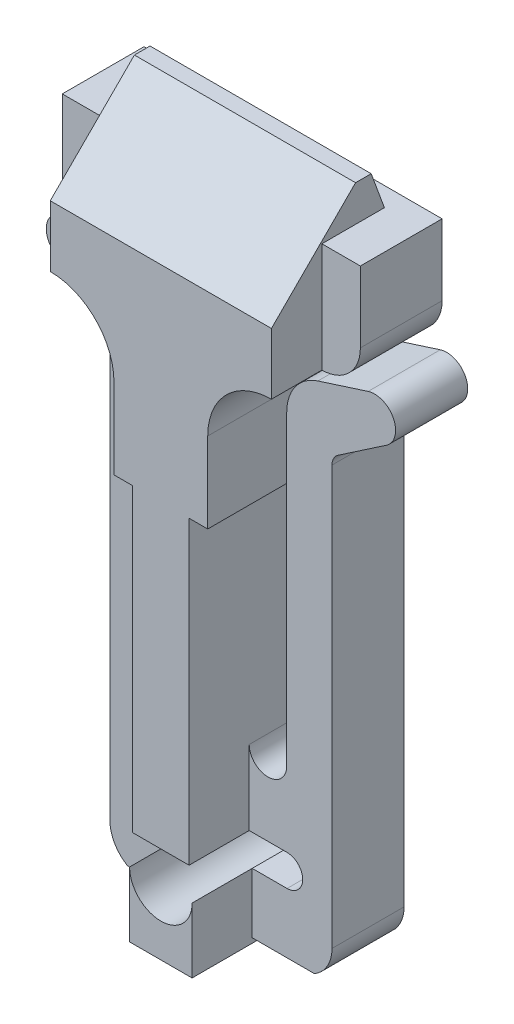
ISO-10303-21;
HEADER;
FILE_DESCRIPTION(('STEP AP214'),'2;1');
FILE_NAME('part.step','',(''),(''),'','','');
FILE_SCHEMA(('AUTOMOTIVE_DESIGN { 1 0 10303 214 1 1 1 1 }'));
ENDSEC;
DATA;
#1=APPLICATION_CONTEXT('core data for automotive mechanical design processes');
#2=APPLICATION_PROTOCOL_DEFINITION('international standard','automotive_design',2000,#1);
#3=PRODUCT_CONTEXT('',#1,'mechanical');
#4=PRODUCT('Part','Part','',(#3));
#5=PRODUCT_RELATED_PRODUCT_CATEGORY('part','',(#4));
#6=PRODUCT_DEFINITION_FORMATION('','',#4);
#7=PRODUCT_DEFINITION_CONTEXT('part definition',#1,'design');
#8=PRODUCT_DEFINITION('design','',#6,#7);
#9=PRODUCT_DEFINITION_SHAPE('','',#8);
#10=(LENGTH_UNIT() NAMED_UNIT(*) SI_UNIT(.MILLI.,.METRE.));
#11=(NAMED_UNIT(*) PLANE_ANGLE_UNIT() SI_UNIT($,.RADIAN.));
#12=(NAMED_UNIT(*) SI_UNIT($,.STERADIAN.) SOLID_ANGLE_UNIT());
#13=UNCERTAINTY_MEASURE_WITH_UNIT(LENGTH_MEASURE(1.E-05),#10,'distance_accuracy_value','');
#14=(GEOMETRIC_REPRESENTATION_CONTEXT(3) GLOBAL_UNCERTAINTY_ASSIGNED_CONTEXT((#13)) GLOBAL_UNIT_ASSIGNED_CONTEXT((#10,
#11,#12)) REPRESENTATION_CONTEXT('',''));
#15=CARTESIAN_POINT('',(0.,0.,0.));
#16=DIRECTION('',(0.,0.,1.));
#17=DIRECTION('',(1.,0.,0.));
#18=AXIS2_PLACEMENT_3D('',#15,#16,#17);
#19=CARTESIAN_POINT('',(-0.780862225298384,3.1,3.40000000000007));
#20=DIRECTION('',(0.,0.,-1.));
#21=DIRECTION('',(-1.,0.,0.));
#22=AXIS2_PLACEMENT_3D('',#19,#20,#21);
#23=CYLINDRICAL_SURFACE('',#22,0.780862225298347);
#24=CARTESIAN_POINT('',(-0.780862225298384,3.1,2.99999999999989));
#25=DIRECTION('',(0.,0.,-1.));
#26=DIRECTION('',(1.,0.,0.));
#27=AXIS2_PLACEMENT_3D('',#24,#25,#26);
#28=CIRCLE('',#27,0.780862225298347);
#29=CARTESIAN_POINT('',(0.,3.1,2.99999999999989));
#30=VERTEX_POINT('',#29);
#31=CARTESIAN_POINT('',(-1.56172445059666,3.1,2.99999999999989));
#32=VERTEX_POINT('',#31);
#33=EDGE_CURVE('E632',#30,#32,#28,.T.);
#34=ORIENTED_EDGE('',*,*,#33,.F.);
#35=DIRECTION('',(0.,0.,-1.));
#36=VECTOR('',#35,1.);
#37=CARTESIAN_POINT('',(0.,3.1,3.40000000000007));
#38=LINE('',#37,#36);
#39=CARTESIAN_POINT('',(0.,3.1,0.));
#40=VERTEX_POINT('',#39);
#41=EDGE_CURVE('E391',#30,#40,#38,.T.);
#42=ORIENTED_EDGE('',*,*,#41,.T.);
#43=CARTESIAN_POINT('',(-0.780862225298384,3.1,0.));
#44=DIRECTION('',(0.,0.,-1.));
#45=DIRECTION('',(-1.,0.,0.));
#46=AXIS2_PLACEMENT_3D('',#43,#44,#45);
#47=CIRCLE('',#46,0.780862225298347);
#48=CARTESIAN_POINT('',(-1.56172445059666,3.1,0.));
#49=VERTEX_POINT('',#48);
#50=EDGE_CURVE('E456',#40,#49,#47,.T.);
#51=ORIENTED_EDGE('',*,*,#50,.T.);
#52=DIRECTION('',(0.,0.,-1.));
#53=VECTOR('',#52,1.);
#54=CARTESIAN_POINT('',(-1.56172445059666,3.1,3.40000000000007));
#55=LINE('',#54,#53);
#56=EDGE_CURVE('E10',#32,#49,#55,.T.);
#57=ORIENTED_EDGE('',*,*,#56,.F.);
#58=EDGE_LOOP('',(#34,#42,#51,#57));
#59=FACE_BOUND('',#58,.T.);
#60=ADVANCED_FACE('F16',(#59),#23,.F.);
#61=CARTESIAN_POINT('',(-1.56172445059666,0.,3.40000000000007));
#62=DIRECTION('',(-1.,0.,0.));
#63=DIRECTION('',(0.,1.,0.));
#64=AXIS2_PLACEMENT_3D('',#61,#62,#63);
#65=PLANE('',#64);
#66=DIRECTION('',(0.,1.,0.));
#67=VECTOR('',#66,1.);
#68=CARTESIAN_POINT('',(-1.56172445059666,3.1,2.99999999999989));
#69=LINE('',#68,#67);
#70=CARTESIAN_POINT('',(-1.56172445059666,15.8500003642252,2.99999999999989));
#71=VERTEX_POINT('',#70);
#72=EDGE_CURVE('E642',#32,#71,#69,.T.);
#73=ORIENTED_EDGE('',*,*,#72,.F.);
#74=ORIENTED_EDGE('',*,*,#56,.T.);
#75=DIRECTION('',(0.,1.,0.));
#76=VECTOR('',#75,1.);
#77=CARTESIAN_POINT('',(-1.56172445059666,0.,0.));
#78=LINE('',#77,#76);
#79=CARTESIAN_POINT('',(-1.56172445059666,15.8500003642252,0.));
#80=VERTEX_POINT('',#79);
#81=EDGE_CURVE('E463',#49,#80,#78,.T.);
#82=ORIENTED_EDGE('',*,*,#81,.T.);
#83=DIRECTION('',(0.,0.,-1.));
#84=VECTOR('',#83,1.);
#85=CARTESIAN_POINT('',(-1.56172445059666,15.8500003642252,3.40000000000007));
#86=LINE('',#85,#84);
#87=EDGE_CURVE('E32',#71,#80,#86,.T.);
#88=ORIENTED_EDGE('',*,*,#87,.F.);
#89=EDGE_LOOP('',(#73,#74,#82,#88));
#90=FACE_BOUND('',#89,.T.);
#91=ADVANCED_FACE('F623',(#90),#65,.F.);
#92=CARTESIAN_POINT('',(-3.4249998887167,15.8500003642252,3.39999999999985));
#93=DIRECTION('',(0.,0.,-1.));
#94=DIRECTION('',(-1.,0.,0.));
#95=AXIS2_PLACEMENT_3D('',#92,#93,#94);
#96=CYLINDRICAL_SURFACE('',#95,1.86327543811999);
#97=CARTESIAN_POINT('',(-3.4249998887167,15.8500003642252,2.99999999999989));
#98=DIRECTION('',(0.,0.,1.));
#99=DIRECTION('',(1.,0.,0.));
#100=AXIS2_PLACEMENT_3D('',#97,#98,#99);
#101=CIRCLE('',#100,1.86327543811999);
#102=CARTESIAN_POINT('',(-2.85739777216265,17.6247181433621,2.99999999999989));
#103=VERTEX_POINT('',#102);
#104=EDGE_CURVE('E728',#71,#103,#101,.T.);
#105=ORIENTED_EDGE('',*,*,#104,.F.);
#106=ORIENTED_EDGE('',*,*,#87,.T.);
#107=CARTESIAN_POINT('',(-3.4249998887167,15.8500003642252,-2.22044604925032E-13));
#108=DIRECTION('',(0.,0.,1.));
#109=DIRECTION('',(-1.,0.,0.));
#110=AXIS2_PLACEMENT_3D('',#107,#108,#109);
#111=CIRCLE('',#110,1.86327543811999);
#112=CARTESIAN_POINT('',(-2.85739777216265,17.6247181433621,-2.22044604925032E-13));
#113=VERTEX_POINT('',#112);
#114=EDGE_CURVE('E460',#80,#113,#111,.T.);
#115=ORIENTED_EDGE('',*,*,#114,.T.);
#116=DIRECTION('',(0.,0.,-1.));
#117=VECTOR('',#116,1.);
#118=CARTESIAN_POINT('',(-2.85739777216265,17.6247181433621,3.39999999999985));
#119=LINE('',#118,#117);
#120=EDGE_CURVE('E513',#103,#113,#119,.T.);
#121=ORIENTED_EDGE('',*,*,#120,.F.);
#122=EDGE_LOOP('',(#105,#106,#115,#121));
#123=FACE_BOUND('',#122,.T.);
#124=ADVANCED_FACE('F628',(#123),#96,.T.);
#125=CARTESIAN_POINT('',(4.84861417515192,15.1601298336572,3.40000000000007));
#126=DIRECTION('',(-0.304625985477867,-0.952472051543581,0.));
#127=DIRECTION('',(-0.952472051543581,0.304625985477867,0.));
#128=AXIS2_PLACEMENT_3D('',#125,#126,#127);
#129=PLANE('',#128);
#130=DIRECTION('',(-0.952472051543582,0.304625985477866,0.));
#131=VECTOR('',#130,1.);
#132=CARTESIAN_POINT('',(-2.85739777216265,17.6247181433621,2.99999999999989));
#133=LINE('',#132,#131);
#134=CARTESIAN_POINT('',(-4.94807856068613,18.2933736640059,2.99999999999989));
#135=VERTEX_POINT('',#134);
#136=EDGE_CURVE('E749',#103,#135,#133,.T.);
#137=ORIENTED_EDGE('',*,*,#136,.F.);
#138=ORIENTED_EDGE('',*,*,#120,.T.);
#139=DIRECTION('',(-0.952472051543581,0.304625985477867,0.));
#140=VECTOR('',#139,1.);
#141=CARTESIAN_POINT('',(4.84861417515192,15.1601298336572,0.));
#142=LINE('',#141,#140);
#143=CARTESIAN_POINT('',(-4.94807856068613,18.2933736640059,-2.22044604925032E-13));
#144=VERTEX_POINT('',#143);
#145=EDGE_CURVE('E450',#113,#144,#142,.T.);
#146=ORIENTED_EDGE('',*,*,#145,.T.);
#147=DIRECTION('',(0.,0.,-1.));
#148=VECTOR('',#147,1.);
#149=CARTESIAN_POINT('',(-4.94807856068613,18.2933736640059,3.39999999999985));
#150=LINE('',#149,#148);
#151=EDGE_CURVE('E516',#135,#144,#150,.T.);
#152=ORIENTED_EDGE('',*,*,#151,.F.);
#153=EDGE_LOOP('',(#137,#138,#146,#152));
#154=FACE_BOUND('',#153,.T.);
#155=ADVANCED_FACE('F587',(#154),#129,.F.);
#156=CARTESIAN_POINT('',(5.97650978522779,8.79139343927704,3.40000000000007));
#157=DIRECTION('',(0.562204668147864,0.826998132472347,0.));
#158=DIRECTION('',(0.,0.,-1.));
#159=AXIS2_PLACEMENT_3D('',#156,#157,#158);
#160=PLANE('',#159);
#161=DIRECTION('',(0.826998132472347,-0.562204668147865,0.));
#162=VECTOR('',#161,1.);
#163=CARTESIAN_POINT('',(-5.70751999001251,16.7343570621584,2.99999999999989));
#164=LINE('',#163,#162);
#165=CARTESIAN_POINT('',(-5.70751999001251,16.7343570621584,2.99999999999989));
#166=VERTEX_POINT('',#165);
#167=CARTESIAN_POINT('',(-3.69893514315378,15.3688935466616,2.99999999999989));
#168=VERTEX_POINT('',#167);
#169=EDGE_CURVE('E756',#166,#168,#164,.T.);
#170=ORIENTED_EDGE('',*,*,#169,.F.);
#171=DIRECTION('',(0.,0.,-1.));
#172=VECTOR('',#171,1.);
#173=CARTESIAN_POINT('',(-5.70751999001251,16.7343570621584,3.39999999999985));
#174=LINE('',#173,#172);
#175=CARTESIAN_POINT('',(-5.70751999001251,16.7343570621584,-2.22044604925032E-13));
#176=VERTEX_POINT('',#175);
#177=EDGE_CURVE('E533',#166,#176,#174,.T.);
#178=ORIENTED_EDGE('',*,*,#177,.T.);
#179=DIRECTION('',(0.826998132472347,-0.562204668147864,0.));
#180=VECTOR('',#179,1.);
#181=CARTESIAN_POINT('',(5.97650978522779,8.79139343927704,0.));
#182=LINE('',#181,#180);
#183=CARTESIAN_POINT('',(-3.69893514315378,15.3688935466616,-2.22044604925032E-13));
#184=VERTEX_POINT('',#183);
#185=EDGE_CURVE('E446',#176,#184,#182,.T.);
#186=ORIENTED_EDGE('',*,*,#185,.T.);
#187=DIRECTION('',(0.,0.,-1.));
#188=VECTOR('',#187,1.);
#189=CARTESIAN_POINT('',(-3.69893514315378,15.3688935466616,3.39999999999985));
#190=LINE('',#189,#188);
#191=EDGE_CURVE('E510',#168,#184,#190,.T.);
#192=ORIENTED_EDGE('',*,*,#191,.F.);
#193=EDGE_LOOP('',(#170,#178,#186,#192));
#194=FACE_BOUND('',#193,.T.);
#195=ADVANCED_FACE('F583',(#194),#160,.F.);
#196=CARTESIAN_POINT('',(-4.0260992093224,14.8876380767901,3.39999999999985));
#197=DIRECTION('',(0.,0.,-1.));
#198=DIRECTION('',(-1.,0.,0.));
#199=AXIS2_PLACEMENT_3D('',#196,#197,#198);
#200=CYLINDRICAL_SURFACE('',#199,0.581930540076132);
#201=CARTESIAN_POINT('',(-4.0260992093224,14.8876380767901,2.99999999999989));
#202=DIRECTION('',(0.,0.,-1.));
#203=DIRECTION('',(1.,0.,0.));
#204=AXIS2_PLACEMENT_3D('',#201,#202,#203);
#205=CIRCLE('',#204,0.581930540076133);
#206=CARTESIAN_POINT('',(-3.44416866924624,14.8876380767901,2.99999999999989));
#207=VERTEX_POINT('',#206);
#208=EDGE_CURVE('E760',#168,#207,#205,.T.);
#209=ORIENTED_EDGE('',*,*,#208,.F.);
#210=ORIENTED_EDGE('',*,*,#191,.T.);
#211=CARTESIAN_POINT('',(-4.0260992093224,14.8876380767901,-2.22044604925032E-13));
#212=DIRECTION('',(0.,0.,-1.));
#213=DIRECTION('',(-1.,0.,0.));
#214=AXIS2_PLACEMENT_3D('',#211,#212,#213);
#215=CIRCLE('',#214,0.581930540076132);
#216=CARTESIAN_POINT('',(-3.44416866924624,14.8876380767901,-2.22044604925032E-13));
#217=VERTEX_POINT('',#216);
#218=EDGE_CURVE('E442',#184,#217,#215,.T.);
#219=ORIENTED_EDGE('',*,*,#218,.T.);
#220=DIRECTION('',(0.,0.,-1.));
#221=VECTOR('',#220,1.);
#222=CARTESIAN_POINT('',(-3.44416866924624,14.8876380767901,3.39999999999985));
#223=LINE('',#222,#221);
#224=EDGE_CURVE('E506',#207,#217,#223,.T.);
#225=ORIENTED_EDGE('',*,*,#224,.F.);
#226=EDGE_LOOP('',(#209,#210,#219,#225));
#227=FACE_BOUND('',#226,.T.);
#228=ADVANCED_FACE('F586',(#227),#200,.F.);
#229=CARTESIAN_POINT('',(-3.44416866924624,0.,3.39999999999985));
#230=DIRECTION('',(1.,0.,0.));
#231=DIRECTION('',(0.,1.,0.));
#232=AXIS2_PLACEMENT_3D('',#229,#230,#231);
#233=PLANE('',#232);
#234=DIRECTION('',(0.,-1.,0.));
#235=VECTOR('',#234,1.);
#236=CARTESIAN_POINT('',(-3.44416866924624,14.8876380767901,2.99999999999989));
#237=LINE('',#236,#235);
#238=CARTESIAN_POINT('',(-3.44416866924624,-2.52687079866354,2.99999999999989));
#239=VERTEX_POINT('',#238);
#240=EDGE_CURVE('E554',#207,#239,#237,.T.);
#241=ORIENTED_EDGE('',*,*,#240,.F.);
#242=ORIENTED_EDGE('',*,*,#224,.T.);
#243=DIRECTION('',(0.,-1.,0.));
#244=VECTOR('',#243,1.);
#245=CARTESIAN_POINT('',(-3.44416866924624,0.,-2.22044604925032E-13));
#246=LINE('',#245,#244);
#247=CARTESIAN_POINT('',(-3.44416866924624,-2.52687079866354,-2.22044604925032E-13));
#248=VERTEX_POINT('',#247);
#249=EDGE_CURVE('E441',#217,#248,#246,.T.);
#250=ORIENTED_EDGE('',*,*,#249,.T.);
#251=DIRECTION('',(0.,0.,-1.));
#252=VECTOR('',#251,1.);
#253=CARTESIAN_POINT('',(-3.44416866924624,-2.52687079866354,3.39999999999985));
#254=LINE('',#253,#252);
#255=EDGE_CURVE('E503',#239,#248,#254,.T.);
#256=ORIENTED_EDGE('',*,*,#255,.F.);
#257=EDGE_LOOP('',(#241,#242,#250,#256));
#258=FACE_BOUND('',#257,.T.);
#259=ADVANCED_FACE('F1513',(#258),#233,.F.);
#260=CARTESIAN_POINT('',(-1.97103946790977,-2.52687079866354,3.40000000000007));
#261=DIRECTION('',(0.,0.,-1.));
#262=DIRECTION('',(-1.,0.,0.));
#263=AXIS2_PLACEMENT_3D('',#260,#261,#262);
#264=CYLINDRICAL_SURFACE('',#263,1.47312920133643);
#265=CARTESIAN_POINT('',(-1.97103946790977,-2.52687079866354,2.99999999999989));
#266=DIRECTION('',(0.,0.,1.));
#267=DIRECTION('',(1.,0.,0.));
#268=AXIS2_PLACEMENT_3D('',#265,#266,#267);
#269=CIRCLE('',#268,1.47312920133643);
#270=CARTESIAN_POINT('',(-2.71215462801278,-3.79999999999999,2.99999999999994));
#271=VERTEX_POINT('',#270);
#272=EDGE_CURVE('E551',#239,#271,#269,.T.);
#273=ORIENTED_EDGE('',*,*,#272,.F.);
#274=ORIENTED_EDGE('',*,*,#255,.T.);
#275=CARTESIAN_POINT('',(-1.97103946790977,-2.52687079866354,0.));
#276=DIRECTION('',(0.,0.,1.));
#277=DIRECTION('',(-1.,0.,0.));
#278=AXIS2_PLACEMENT_3D('',#275,#276,#277);
#279=CIRCLE('',#278,1.47312920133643);
#280=CARTESIAN_POINT('',(-1.97103946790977,-4.,0.));
#281=VERTEX_POINT('',#280);
#282=EDGE_CURVE('E437',#248,#281,#279,.T.);
#283=ORIENTED_EDGE('',*,*,#282,.T.);
#284=DIRECTION('',(0.,0.,-1.));
#285=VECTOR('',#284,1.);
#286=CARTESIAN_POINT('',(-1.97103946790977,-4.,3.40000000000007));
#287=LINE('',#286,#285);
#288=CARTESIAN_POINT('',(-1.97103946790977,-4.,2.39999999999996));
#289=VERTEX_POINT('',#288);
#290=EDGE_CURVE('E345',#289,#281,#287,.T.);
#291=ORIENTED_EDGE('',*,*,#290,.F.);
#292=CARTESIAN_POINT('',(-2.7121546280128,-3.79999999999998,2.99999999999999));
#293=CARTESIAN_POINT('',(-2.66879450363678,-3.82522556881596,2.96633746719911));
#294=CARTESIAN_POINT('',(-2.62476354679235,-3.84790778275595,2.93170100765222));
#295=CARTESIAN_POINT('',(-2.53570370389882,-3.88836405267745,2.86095205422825));
#296=CARTESIAN_POINT('',(-2.49067565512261,-3.90614206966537,2.8248407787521));
#297=CARTESIAN_POINT('',(-2.40010644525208,-3.93693653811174,2.75172943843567));
#298=CARTESIAN_POINT('',(-2.3545686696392,-3.94997487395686,2.7147343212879));
#299=CARTESIAN_POINT('',(-2.26301340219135,-3.9715418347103,2.64003909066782));
#300=CARTESIAN_POINT('',(-2.21699584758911,-3.98006986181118,2.60233888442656));
#301=CARTESIAN_POINT('',(-2.10638659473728,-3.9952099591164,2.51150901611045));
#302=CARTESIAN_POINT('',(-2.04165159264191,-3.99972803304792,2.45817786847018));
#303=CARTESIAN_POINT('',(-1.97498904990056,-3.99999602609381,2.40325409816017));
#304=CARTESIAN_POINT('',(-1.97301423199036,-3.99999999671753,2.40162702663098));
#305=CARTESIAN_POINT('',(-1.97103946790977,-3.99999999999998,2.39999999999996));
#306=B_SPLINE_CURVE_WITH_KNOTS('',3,(#292,#293,#294,#295,#296,#297,#298,#299,#300,#301,#302,
#303,#304,#305),.UNSPECIFIED.,.F.,.F.,(4,2,2,2,2,2,4),(0.,0.18111513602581,0.362083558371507,
0.542205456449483,0.722351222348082,0.97379202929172,0.98146831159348),.UNSPECIFIED.);
#307=EDGE_CURVE('E19',#289,#271,#306,.F.);
#308=ORIENTED_EDGE('',*,*,#307,.T.);
#309=EDGE_LOOP('',(#273,#274,#283,#291,#308));
#310=FACE_BOUND('',#309,.T.);
#311=ADVANCED_FACE('F1692',(#310),#264,.T.);
#312=CARTESIAN_POINT('',(4.32103946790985,-2.52687079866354,3.40000000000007));
#313=DIRECTION('',(0.,0.,-1.));
#314=DIRECTION('',(-1.,0.,0.));
#315=AXIS2_PLACEMENT_3D('',#312,#313,#314);
#316=CYLINDRICAL_SURFACE('',#315,1.47312920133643);
#317=DIRECTION('',(0.,0.,-1.));
#318=VECTOR('',#317,1.);
#319=CARTESIAN_POINT('',(5.7941686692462,-2.52687079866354,3.40000000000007));
#320=LINE('',#319,#318);
#321=CARTESIAN_POINT('',(5.7941686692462,-2.52687079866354,2.99999999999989));
#322=VERTEX_POINT('',#321);
#323=CARTESIAN_POINT('',(5.7941686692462,-2.52687079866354,0.));
#324=VERTEX_POINT('',#323);
#325=EDGE_CURVE('E498',#322,#324,#320,.T.);
#326=ORIENTED_EDGE('',*,*,#325,.F.);
#327=CARTESIAN_POINT('',(4.32103946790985,-2.52687079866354,2.99999999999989));
#328=DIRECTION('',(0.,0.,1.));
#329=DIRECTION('',(1.,0.,0.));
#330=AXIS2_PLACEMENT_3D('',#327,#328,#329);
#331=CIRCLE('',#330,1.47312920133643);
#332=CARTESIAN_POINT('',(5.06215462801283,-3.80000000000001,2.99999999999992));
#333=VERTEX_POINT('',#332);
#334=EDGE_CURVE('E528',#333,#322,#331,.T.);
#335=ORIENTED_EDGE('',*,*,#334,.F.);
#336=CARTESIAN_POINT('',(5.06215462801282,-3.80000000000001,2.99999999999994));
#337=CARTESIAN_POINT('',(5.0187945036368,-3.82522556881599,2.96633746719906));
#338=CARTESIAN_POINT('',(4.97476354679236,-3.84790778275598,2.93170100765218));
#339=CARTESIAN_POINT('',(4.88570370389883,-3.88836405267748,2.8609520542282));
#340=CARTESIAN_POINT('',(4.84067565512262,-3.9061420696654,2.82484077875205));
#341=CARTESIAN_POINT('',(4.75010644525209,-3.93693653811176,2.75172943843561));
#342=CARTESIAN_POINT('',(4.70456866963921,-3.94997487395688,2.71473432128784));
#343=CARTESIAN_POINT('',(4.61301340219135,-3.97154183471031,2.64003909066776));
#344=CARTESIAN_POINT('',(4.56699584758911,-3.98006986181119,2.60233888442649));
#345=CARTESIAN_POINT('',(4.4563865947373,-3.9952099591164,2.51150901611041));
#346=CARTESIAN_POINT('',(4.39165159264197,-3.99972803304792,2.45817786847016));
#347=CARTESIAN_POINT('',(4.32498904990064,-3.99999602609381,2.40325409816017));
#348=CARTESIAN_POINT('',(4.32301423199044,-3.99999999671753,2.40162702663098));
#349=CARTESIAN_POINT('',(4.32103946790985,-3.99999999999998,2.39999999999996));
#350=B_SPLINE_CURVE_WITH_KNOTS('',3,(#336,#337,#338,#339,#340,#341,#342,#343,#344,#345,#346,
#347,#348,#349),.UNSPECIFIED.,.F.,.F.,(4,2,2,2,2,2,4),(0.,0.181115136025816,0.362083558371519,
0.542205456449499,0.722351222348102,0.973792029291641,0.9814683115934),.UNSPECIFIED.);
#351=CARTESIAN_POINT('',(4.32103946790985,-3.99999999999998,2.39999999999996));
#352=VERTEX_POINT('',#351);
#353=EDGE_CURVE('E477',#333,#352,#350,.T.);
#354=ORIENTED_EDGE('',*,*,#353,.T.);
#355=DIRECTION('',(0.,0.,-1.));
#356=VECTOR('',#355,1.);
#357=CARTESIAN_POINT('',(4.32103946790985,-4.,3.40000000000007));
#358=LINE('',#357,#356);
#359=CARTESIAN_POINT('',(4.32103946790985,-4.,0.));
#360=VERTEX_POINT('',#359);
#361=EDGE_CURVE('E310',#352,#360,#358,.T.);
#362=ORIENTED_EDGE('',*,*,#361,.T.);
#363=CARTESIAN_POINT('',(4.32103946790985,-2.52687079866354,0.));
#364=DIRECTION('',(0.,0.,-1.));
#365=DIRECTION('',(-1.,0.,0.));
#366=AXIS2_PLACEMENT_3D('',#363,#364,#365);
#367=CIRCLE('',#366,1.47312920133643);
#368=EDGE_CURVE('E89',#324,#360,#367,.T.);
#369=ORIENTED_EDGE('',*,*,#368,.F.);
#370=EDGE_LOOP('',(#326,#335,#354,#362,#369));
#371=FACE_BOUND('',#370,.T.);
#372=ADVANCED_FACE('F562',(#371),#316,.T.);
#373=CARTESIAN_POINT('',(5.7941686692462,0.,3.40000000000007));
#374=DIRECTION('',(1.,0.,0.));
#375=DIRECTION('',(0.,-1.,0.));
#376=AXIS2_PLACEMENT_3D('',#373,#374,#375);
#377=PLANE('',#376);
#378=DIRECTION('',(0.,0.,-1.));
#379=VECTOR('',#378,1.);
#380=CARTESIAN_POINT('',(5.7941686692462,14.8876380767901,3.40000000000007));
#381=LINE('',#380,#379);
#382=CARTESIAN_POINT('',(5.7941686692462,14.8876380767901,2.99999999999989));
#383=VERTEX_POINT('',#382);
#384=CARTESIAN_POINT('',(5.7941686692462,14.8876380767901,0.));
#385=VERTEX_POINT('',#384);
#386=EDGE_CURVE('E495',#383,#385,#381,.T.);
#387=ORIENTED_EDGE('',*,*,#386,.F.);
#388=DIRECTION('',(0.,1.,0.));
#389=VECTOR('',#388,1.);
#390=CARTESIAN_POINT('',(5.7941686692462,-2.52687079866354,2.99999999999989));
#391=LINE('',#390,#389);
#392=EDGE_CURVE('E532',#322,#383,#391,.T.);
#393=ORIENTED_EDGE('',*,*,#392,.F.);
#394=ORIENTED_EDGE('',*,*,#325,.T.);
#395=DIRECTION('',(0.,-1.,0.));
#396=VECTOR('',#395,1.);
#397=CARTESIAN_POINT('',(5.7941686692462,0.,0.));
#398=LINE('',#397,#396);
#399=EDGE_CURVE('E438',#385,#324,#398,.T.);
#400=ORIENTED_EDGE('',*,*,#399,.F.);
#401=EDGE_LOOP('',(#387,#393,#394,#400));
#402=FACE_BOUND('',#401,.T.);
#403=ADVANCED_FACE('F610',(#402),#377,.T.);
#404=CARTESIAN_POINT('',(6.37609920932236,14.8876380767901,3.40000000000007));
#405=DIRECTION('',(0.,0.,-1.));
#406=DIRECTION('',(-1.,0.,0.));
#407=AXIS2_PLACEMENT_3D('',#404,#405,#406);
#408=CYLINDRICAL_SURFACE('',#407,0.581930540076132);
#409=DIRECTION('',(0.,0.,-1.));
#410=VECTOR('',#409,1.);
#411=CARTESIAN_POINT('',(6.04893514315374,15.3688935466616,3.40000000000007));
#412=LINE('',#411,#410);
#413=CARTESIAN_POINT('',(6.04893514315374,15.3688935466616,2.99999999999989));
#414=VERTEX_POINT('',#413);
#415=CARTESIAN_POINT('',(6.04893514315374,15.3688935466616,0.));
#416=VERTEX_POINT('',#415);
#417=EDGE_CURVE('E499',#414,#416,#412,.T.);
#418=ORIENTED_EDGE('',*,*,#417,.F.);
#419=CARTESIAN_POINT('',(6.37609920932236,14.8876380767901,2.99999999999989));
#420=DIRECTION('',(0.,0.,-1.));
#421=DIRECTION('',(1.,0.,0.));
#422=AXIS2_PLACEMENT_3D('',#419,#420,#421);
#423=CIRCLE('',#422,0.581930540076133);
#424=EDGE_CURVE('E665',#383,#414,#423,.T.);
#425=ORIENTED_EDGE('',*,*,#424,.F.);
#426=ORIENTED_EDGE('',*,*,#386,.T.);
#427=CARTESIAN_POINT('',(6.37609920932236,14.8876380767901,0.));
#428=DIRECTION('',(0.,0.,1.));
#429=DIRECTION('',(-1.,0.,0.));
#430=AXIS2_PLACEMENT_3D('',#427,#428,#429);
#431=CIRCLE('',#430,0.581930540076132);
#432=EDGE_CURVE('E772',#416,#385,#431,.T.);
#433=ORIENTED_EDGE('',*,*,#432,.F.);
#434=EDGE_LOOP('',(#418,#425,#426,#433));
#435=FACE_BOUND('',#434,.T.);
#436=ADVANCED_FACE('F608',(#435),#408,.F.);
#437=CARTESIAN_POINT('',(-5.23373567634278,7.69877924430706,3.39999999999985));
#438=DIRECTION('',(0.562204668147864,-0.826998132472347,0.));
#439=DIRECTION('',(0.,0.,-1.));
#440=AXIS2_PLACEMENT_3D('',#437,#438,#439);
#441=PLANE('',#440);
#442=DIRECTION('',(0.,0.,-1.));
#443=VECTOR('',#442,1.);
#444=CARTESIAN_POINT('',(8.05751999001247,16.7343570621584,3.40000000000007));
#445=LINE('',#444,#443);
#446=CARTESIAN_POINT('',(8.05751999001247,16.7343570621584,2.99999999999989));
#447=VERTEX_POINT('',#446);
#448=CARTESIAN_POINT('',(8.05751999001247,16.7343570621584,0.));
#449=VERTEX_POINT('',#448);
#450=EDGE_CURVE('E494',#447,#449,#445,.T.);
#451=ORIENTED_EDGE('',*,*,#450,.F.);
#452=DIRECTION('',(0.826998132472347,0.562204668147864,0.));
#453=VECTOR('',#452,1.);
#454=CARTESIAN_POINT('',(6.04893514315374,15.3688935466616,2.99999999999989));
#455=LINE('',#454,#453);
#456=EDGE_CURVE('E668',#414,#447,#455,.T.);
#457=ORIENTED_EDGE('',*,*,#456,.F.);
#458=ORIENTED_EDGE('',*,*,#417,.T.);
#459=DIRECTION('',(-0.826998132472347,-0.562204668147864,0.));
#460=VECTOR('',#459,1.);
#461=CARTESIAN_POINT('',(-5.23373567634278,7.69877924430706,-2.22044604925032E-13));
#462=LINE('',#461,#460);
#463=EDGE_CURVE('E776',#449,#416,#462,.T.);
#464=ORIENTED_EDGE('',*,*,#463,.F.);
#465=EDGE_LOOP('',(#451,#457,#458,#464));
#466=FACE_BOUND('',#465,.T.);
#467=ADVANCED_FACE('F606',(#466),#441,.T.);
#468=CARTESIAN_POINT('',(7.56496528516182,17.4589007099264,3.40000000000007));
#469=DIRECTION('',(0.,0.,-1.));
#470=DIRECTION('',(-1.,0.,0.));
#471=AXIS2_PLACEMENT_3D('',#468,#469,#470);
#472=CYLINDRICAL_SURFACE('',#471,0.876112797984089);
#473=DIRECTION('',(0.,0.,-1.));
#474=VECTOR('',#473,1.);
#475=CARTESIAN_POINT('',(7.29807856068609,18.2933736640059,3.40000000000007));
#476=LINE('',#475,#474);
#477=CARTESIAN_POINT('',(7.29807856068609,18.2933736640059,2.99999999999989));
#478=VERTEX_POINT('',#477);
#479=CARTESIAN_POINT('',(7.29807856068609,18.2933736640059,0.));
#480=VERTEX_POINT('',#479);
#481=EDGE_CURVE('E490',#478,#480,#476,.T.);
#482=ORIENTED_EDGE('',*,*,#481,.F.);
#483=CARTESIAN_POINT('',(7.56496528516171,17.4589007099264,2.99999999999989));
#484=DIRECTION('',(0.,0.,1.));
#485=DIRECTION('',(1.,0.,0.));
#486=AXIS2_PLACEMENT_3D('',#483,#484,#485);
#487=CIRCLE('',#486,0.876112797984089);
#488=EDGE_CURVE('E669',#447,#478,#487,.T.);
#489=ORIENTED_EDGE('',*,*,#488,.F.);
#490=ORIENTED_EDGE('',*,*,#450,.T.);
#491=CARTESIAN_POINT('',(7.56496528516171,17.4589007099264,0.));
#492=DIRECTION('',(0.,0.,-1.));
#493=DIRECTION('',(-1.,0.,0.));
#494=AXIS2_PLACEMENT_3D('',#491,#492,#493);
#495=CIRCLE('',#494,0.876112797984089);
#496=EDGE_CURVE('E434',#480,#449,#495,.T.);
#497=ORIENTED_EDGE('',*,*,#496,.F.);
#498=EDGE_LOOP('',(#482,#489,#490,#497));
#499=FACE_BOUND('',#498,.T.);
#500=ADVANCED_FACE('F603',(#499),#472,.T.);
#501=CARTESIAN_POINT('',(-4.6305412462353,14.4782826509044,3.39999999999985));
#502=DIRECTION('',(-0.304625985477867,0.952472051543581,0.));
#503=DIRECTION('',(0.,0.,1.));
#504=AXIS2_PLACEMENT_3D('',#501,#502,#503);
#505=PLANE('',#504);
#506=DIRECTION('',(0.,0.,-1.));
#507=VECTOR('',#506,1.);
#508=CARTESIAN_POINT('',(5.20739777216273,17.6247181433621,3.40000000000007));
#509=LINE('',#508,#507);
#510=CARTESIAN_POINT('',(5.20739777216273,17.6247181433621,2.99999999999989));
#511=VERTEX_POINT('',#510);
#512=CARTESIAN_POINT('',(5.20739777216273,17.6247181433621,0.));
#513=VERTEX_POINT('',#512);
#514=EDGE_CURVE('E486',#511,#513,#509,.T.);
#515=ORIENTED_EDGE('',*,*,#514,.F.);
#516=DIRECTION('',(-0.952472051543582,-0.304625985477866,0.));
#517=VECTOR('',#516,1.);
#518=CARTESIAN_POINT('',(7.29807856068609,18.2933736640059,2.99999999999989));
#519=LINE('',#518,#517);
#520=EDGE_CURVE('E673',#478,#511,#519,.T.);
#521=ORIENTED_EDGE('',*,*,#520,.F.);
#522=ORIENTED_EDGE('',*,*,#481,.T.);
#523=DIRECTION('',(0.952472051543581,0.304625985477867,0.));
#524=VECTOR('',#523,1.);
#525=CARTESIAN_POINT('',(-4.6305412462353,14.4782826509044,-2.22044604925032E-13));
#526=LINE('',#525,#524);
#527=EDGE_CURVE('E430',#513,#480,#526,.T.);
#528=ORIENTED_EDGE('',*,*,#527,.F.);
#529=EDGE_LOOP('',(#515,#521,#522,#528));
#530=FACE_BOUND('',#529,.T.);
#531=ADVANCED_FACE('F596',(#530),#505,.T.);
#532=CARTESIAN_POINT('',(5.77499988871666,15.8500003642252,3.40000000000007));
#533=DIRECTION('',(0.,0.,-1.));
#534=DIRECTION('',(-1.,0.,0.));
#535=AXIS2_PLACEMENT_3D('',#532,#533,#534);
#536=CYLINDRICAL_SURFACE('',#535,1.86327543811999);
#537=DIRECTION('',(0.,0.,-1.));
#538=VECTOR('',#537,1.);
#539=CARTESIAN_POINT('',(3.91172445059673,15.8500003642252,3.40000000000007));
#540=LINE('',#539,#538);
#541=CARTESIAN_POINT('',(3.91172445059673,15.8500003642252,2.99999999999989));
#542=VERTEX_POINT('',#541);
#543=CARTESIAN_POINT('',(3.91172445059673,15.8500003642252,0.));
#544=VERTEX_POINT('',#543);
#545=EDGE_CURVE('E483',#542,#544,#540,.T.);
#546=ORIENTED_EDGE('',*,*,#545,.F.);
#547=CARTESIAN_POINT('',(5.77499988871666,15.8500003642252,2.99999999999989));
#548=DIRECTION('',(0.,0.,1.));
#549=DIRECTION('',(1.,0.,0.));
#550=AXIS2_PLACEMENT_3D('',#547,#548,#549);
#551=CIRCLE('',#550,1.86327543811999);
#552=EDGE_CURVE('E674',#511,#542,#551,.T.);
#553=ORIENTED_EDGE('',*,*,#552,.F.);
#554=ORIENTED_EDGE('',*,*,#514,.T.);
#555=CARTESIAN_POINT('',(5.77499988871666,15.8500003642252,0.));
#556=DIRECTION('',(0.,0.,-1.));
#557=DIRECTION('',(-1.,0.,0.));
#558=AXIS2_PLACEMENT_3D('',#555,#556,#557);
#559=CIRCLE('',#558,1.86327543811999);
#560=EDGE_CURVE('E429',#544,#513,#559,.T.);
#561=ORIENTED_EDGE('',*,*,#560,.F.);
#562=EDGE_LOOP('',(#546,#553,#554,#561));
#563=FACE_BOUND('',#562,.T.);
#564=ADVANCED_FACE('F593',(#563),#536,.T.);
#565=CARTESIAN_POINT('',(3.91172445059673,0.,3.40000000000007));
#566=DIRECTION('',(-1.,0.,0.));
#567=DIRECTION('',(0.,0.,1.));
#568=AXIS2_PLACEMENT_3D('',#565,#566,#567);
#569=PLANE('',#568);
#570=DIRECTION('',(0.,0.,-1.));
#571=VECTOR('',#570,1.);
#572=CARTESIAN_POINT('',(3.91172445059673,3.1,3.40000000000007));
#573=LINE('',#572,#571);
#574=CARTESIAN_POINT('',(3.91172445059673,3.1,2.99999999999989));
#575=VERTEX_POINT('',#574);
#576=CARTESIAN_POINT('',(3.91172445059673,3.1,0.));
#577=VERTEX_POINT('',#576);
#578=EDGE_CURVE('E480',#575,#577,#573,.T.);
#579=ORIENTED_EDGE('',*,*,#578,.F.);
#580=DIRECTION('',(0.,-1.,0.));
#581=VECTOR('',#580,1.);
#582=CARTESIAN_POINT('',(3.91172445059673,15.8500003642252,2.99999999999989));
#583=LINE('',#582,#581);
#584=EDGE_CURVE('E678',#542,#575,#583,.T.);
#585=ORIENTED_EDGE('',*,*,#584,.F.);
#586=ORIENTED_EDGE('',*,*,#545,.T.);
#587=DIRECTION('',(0.,1.,0.));
#588=VECTOR('',#587,1.);
#589=CARTESIAN_POINT('',(3.91172445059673,0.,0.));
#590=LINE('',#589,#588);
#591=EDGE_CURVE('E425',#577,#544,#590,.T.);
#592=ORIENTED_EDGE('',*,*,#591,.F.);
#593=EDGE_LOOP('',(#579,#585,#586,#592));
#594=FACE_BOUND('',#593,.T.);
#595=ADVANCED_FACE('F591',(#594),#569,.T.);
#596=CARTESIAN_POINT('',(3.13086222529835,3.1,3.40000000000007));
#597=DIRECTION('',(0.,0.,-1.));
#598=DIRECTION('',(-1.,0.,0.));
#599=AXIS2_PLACEMENT_3D('',#596,#597,#598);
#600=CYLINDRICAL_SURFACE('',#599,0.780862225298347);
#601=DIRECTION('',(0.,0.,-1.));
#602=VECTOR('',#601,1.);
#603=CARTESIAN_POINT('',(2.34999999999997,3.1,3.40000000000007));
#604=LINE('',#603,#602);
#605=CARTESIAN_POINT('',(2.34999999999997,3.1,2.99999999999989));
#606=VERTEX_POINT('',#605);
#607=CARTESIAN_POINT('',(2.34999999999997,3.1,0.));
#608=VERTEX_POINT('',#607);
#609=EDGE_CURVE('E390',#606,#608,#604,.T.);
#610=ORIENTED_EDGE('',*,*,#609,.F.);
#611=CARTESIAN_POINT('',(3.13086222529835,3.1,2.99999999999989));
#612=DIRECTION('',(0.,0.,-1.));
#613=DIRECTION('',(1.,0.,0.));
#614=AXIS2_PLACEMENT_3D('',#611,#612,#613);
#615=CIRCLE('',#614,0.780862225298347);
#616=EDGE_CURVE('E686',#575,#606,#615,.T.);
#617=ORIENTED_EDGE('',*,*,#616,.F.);
#618=ORIENTED_EDGE('',*,*,#578,.T.);
#619=CARTESIAN_POINT('',(3.13086222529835,3.1,0.));
#620=DIRECTION('',(0.,0.,1.));
#621=DIRECTION('',(-1.,0.,0.));
#622=AXIS2_PLACEMENT_3D('',#619,#620,#621);
#623=CIRCLE('',#622,0.780862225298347);
#624=EDGE_CURVE('E420',#608,#577,#623,.T.);
#625=ORIENTED_EDGE('',*,*,#624,.F.);
#626=EDGE_LOOP('',(#610,#617,#618,#625));
#627=FACE_BOUND('',#626,.T.);
#628=ADVANCED_FACE('F581',(#627),#600,.F.);
#629=CARTESIAN_POINT('',(0.,-1.29999999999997,0.));
#630=DIRECTION('',(0.,-1.,0.));
#631=DIRECTION('',(0.,0.,-1.));
#632=AXIS2_PLACEMENT_3D('',#629,#630,#631);
#633=PLANE('',#632);
#634=DIRECTION('',(-1.,0.,0.));
#635=VECTOR('',#634,1.);
#636=CARTESIAN_POINT('',(3.92499999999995,-1.29999999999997,2.99999999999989));
#637=LINE('',#636,#635);
#638=CARTESIAN_POINT('',(3.92499999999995,-1.29999999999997,2.99999999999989));
#639=VERTEX_POINT('',#638);
#640=CARTESIAN_POINT('',(2.475,-1.29999999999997,2.99999999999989));
#641=VERTEX_POINT('',#640);
#642=EDGE_CURVE('E700',#639,#641,#637,.T.);
#643=ORIENTED_EDGE('',*,*,#642,.F.);
#644=DIRECTION('',(0.,0.,1.));
#645=VECTOR('',#644,1.);
#646=CARTESIAN_POINT('',(3.92499999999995,-1.29999999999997,0.));
#647=LINE('',#646,#645);
#648=CARTESIAN_POINT('',(3.92499999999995,-1.29999999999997,0.));
#649=VERTEX_POINT('',#648);
#650=EDGE_CURVE('E476',#649,#639,#647,.T.);
#651=ORIENTED_EDGE('',*,*,#650,.F.);
#652=DIRECTION('',(1.,0.,0.));
#653=VECTOR('',#652,1.);
#654=CARTESIAN_POINT('',(0.,-1.29999999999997,0.));
#655=LINE('',#654,#653);
#656=CARTESIAN_POINT('',(2.475,-1.29999999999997,0.));
#657=VERTEX_POINT('',#656);
#658=EDGE_CURVE('E468',#657,#649,#655,.T.);
#659=ORIENTED_EDGE('',*,*,#658,.F.);
#660=DIRECTION('',(0.,0.,1.));
#661=VECTOR('',#660,1.);
#662=CARTESIAN_POINT('',(2.475,-1.29999999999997,0.));
#663=LINE('',#662,#661);
#664=EDGE_CURVE('E785',#657,#641,#663,.T.);
#665=ORIENTED_EDGE('',*,*,#664,.T.);
#666=EDGE_LOOP('',(#643,#651,#659,#665));
#667=FACE_BOUND('',#666,.T.);
#668=ADVANCED_FACE('F578',(#667),#633,.F.);
#669=CARTESIAN_POINT('',(0.,-1.29999999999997,0.));
#670=DIRECTION('',(0.,-1.,0.));
#671=DIRECTION('',(0.,0.,-1.));
#672=AXIS2_PLACEMENT_3D('',#669,#670,#671);
#673=PLANE('',#672);
#674=DIRECTION('',(-1.,0.,0.));
#675=VECTOR('',#674,1.);
#676=CARTESIAN_POINT('',(-0.125000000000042,-1.29999999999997,2.99999999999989));
#677=LINE('',#676,#675);
#678=CARTESIAN_POINT('',(-0.125000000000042,-1.29999999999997,2.99999999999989));
#679=VERTEX_POINT('',#678);
#680=CARTESIAN_POINT('',(-1.575,-1.29999999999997,2.99999999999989));
#681=VERTEX_POINT('',#680);
#682=EDGE_CURVE('E679',#679,#681,#677,.T.);
#683=ORIENTED_EDGE('',*,*,#682,.F.);
#684=DIRECTION('',(0.,0.,1.));
#685=VECTOR('',#684,1.);
#686=CARTESIAN_POINT('',(-0.125000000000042,-1.29999999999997,0.));
#687=LINE('',#686,#685);
#688=CARTESIAN_POINT('',(-0.125000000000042,-1.29999999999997,0.));
#689=VERTEX_POINT('',#688);
#690=EDGE_CURVE('E790',#689,#679,#687,.T.);
#691=ORIENTED_EDGE('',*,*,#690,.F.);
#692=DIRECTION('',(1.,0.,0.));
#693=VECTOR('',#692,1.);
#694=CARTESIAN_POINT('',(0.,-1.29999999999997,0.));
#695=LINE('',#694,#693);
#696=CARTESIAN_POINT('',(-1.575,-1.29999999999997,0.));
#697=VERTEX_POINT('',#696);
#698=EDGE_CURVE('E455',#697,#689,#695,.T.);
#699=ORIENTED_EDGE('',*,*,#698,.F.);
#700=DIRECTION('',(0.,0.,1.));
#701=VECTOR('',#700,1.);
#702=CARTESIAN_POINT('',(-1.575,-1.29999999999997,0.));
#703=LINE('',#702,#701);
#704=EDGE_CURVE('E472',#697,#681,#703,.T.);
#705=ORIENTED_EDGE('',*,*,#704,.T.);
#706=EDGE_LOOP('',(#683,#691,#699,#705));
#707=FACE_BOUND('',#706,.T.);
#708=ADVANCED_FACE('F576',(#707),#673,.F.);
#709=CARTESIAN_POINT('',(-1.575,-0.650000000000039,0.));
#710=DIRECTION('',(0.,0.,1.));
#711=DIRECTION('',(1.,0.,0.));
#712=AXIS2_PLACEMENT_3D('',#709,#710,#711);
#713=CYLINDRICAL_SURFACE('',#712,0.65);
#714=CARTESIAN_POINT('',(-1.575,-0.650000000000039,2.99999999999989));
#715=DIRECTION('',(0.,0.,-1.));
#716=DIRECTION('',(1.,0.,0.));
#717=AXIS2_PLACEMENT_3D('',#714,#715,#716);
#718=CIRCLE('',#717,0.65);
#719=CARTESIAN_POINT('',(-1.575,0.,2.99999999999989));
#720=VERTEX_POINT('',#719);
#721=EDGE_CURVE('E660',#681,#720,#718,.T.);
#722=ORIENTED_EDGE('',*,*,#721,.F.);
#723=ORIENTED_EDGE('',*,*,#704,.F.);
#724=CARTESIAN_POINT('',(-1.575,-0.650000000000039,0.));
#725=DIRECTION('',(0.,0.,1.));
#726=DIRECTION('',(1.,0.,0.));
#727=AXIS2_PLACEMENT_3D('',#724,#725,#726);
#728=CIRCLE('',#727,0.65);
#729=CARTESIAN_POINT('',(-1.575,0.,0.));
#730=VERTEX_POINT('',#729);
#731=EDGE_CURVE('E451',#730,#697,#728,.T.);
#732=ORIENTED_EDGE('',*,*,#731,.F.);
#733=DIRECTION('',(0.,0.,1.));
#734=VECTOR('',#733,1.);
#735=CARTESIAN_POINT('',(-1.575,0.,0.));
#736=LINE('',#735,#734);
#737=EDGE_CURVE('E895',#730,#720,#736,.T.);
#738=ORIENTED_EDGE('',*,*,#737,.T.);
#739=EDGE_LOOP('',(#722,#723,#732,#738));
#740=FACE_BOUND('',#739,.T.);
#741=ADVANCED_FACE('F570',(#740),#713,.F.);
#742=CARTESIAN_POINT('',(0.,-3.,2.39999999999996));
#743=DIRECTION('',(1.,0.,0.));
#744=DIRECTION('',(0.,0.,-1.));
#745=AXIS2_PLACEMENT_3D('',#742,#743,#744);
#746=CYLINDRICAL_SURFACE('',#745,1.);
#747=ORIENTED_EDGE('',*,*,#353,.F.);
#748=DIRECTION('',(-1.,0.,0.));
#749=VECTOR('',#748,1.);
#750=CARTESIAN_POINT('',(0.,-3.8,2.99999999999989));
#751=LINE('',#750,#749);
#752=CARTESIAN_POINT('',(2.475,-3.8,2.99999999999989));
#753=VERTEX_POINT('',#752);
#754=EDGE_CURVE('E522',#333,#753,#751,.T.);
#755=ORIENTED_EDGE('',*,*,#754,.T.);
#756=CARTESIAN_POINT('',(2.475,-3.,2.39999999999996));
#757=DIRECTION('',(-1.,0.,0.));
#758=DIRECTION('',(0.,0.,1.));
#759=AXIS2_PLACEMENT_3D('',#756,#757,#758);
#760=CIRCLE('',#759,1.);
#761=CARTESIAN_POINT('',(2.475,-4.,2.39999999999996));
#762=VERTEX_POINT('',#761);
#763=EDGE_CURVE('E740',#762,#753,#760,.T.);
#764=ORIENTED_EDGE('',*,*,#763,.F.);
#765=DIRECTION('',(-1.,0.,0.));
#766=VECTOR('',#765,1.);
#767=CARTESIAN_POINT('',(2.475,-4.,2.39999999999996));
#768=LINE('',#767,#766);
#769=EDGE_CURVE('E534',#352,#762,#768,.T.);
#770=ORIENTED_EDGE('',*,*,#769,.F.);
#771=EDGE_LOOP('',(#747,#755,#764,#770));
#772=FACE_BOUND('',#771,.T.);
#773=ADVANCED_FACE('F565',(#772),#746,.T.);
#774=CARTESIAN_POINT('',(0.,-3.,2.39999999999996));
#775=DIRECTION('',(1.,0.,0.));
#776=DIRECTION('',(0.,0.,-1.));
#777=AXIS2_PLACEMENT_3D('',#774,#775,#776);
#778=CYLINDRICAL_SURFACE('',#777,1.);
#779=CARTESIAN_POINT('',(-0.125000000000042,-3.,2.39999999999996));
#780=DIRECTION('',(1.,0.,0.));
#781=DIRECTION('',(0.,1.,0.));
#782=AXIS2_PLACEMENT_3D('',#779,#780,#781);
#783=CIRCLE('',#782,1.);
#784=CARTESIAN_POINT('',(-0.125000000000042,-3.8,2.99999999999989));
#785=VERTEX_POINT('',#784);
#786=CARTESIAN_POINT('',(-0.125000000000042,-4.,2.39999999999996));
#787=VERTEX_POINT('',#786);
#788=EDGE_CURVE('E768',#785,#787,#783,.T.);
#789=ORIENTED_EDGE('',*,*,#788,.F.);
#790=DIRECTION('',(-1.,0.,0.));
#791=VECTOR('',#790,1.);
#792=CARTESIAN_POINT('',(0.,-3.8,2.99999999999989));
#793=LINE('',#792,#791);
#794=EDGE_CURVE('E547',#785,#271,#793,.T.);
#795=ORIENTED_EDGE('',*,*,#794,.T.);
#796=ORIENTED_EDGE('',*,*,#307,.F.);
#797=DIRECTION('',(-1.,0.,0.));
#798=VECTOR('',#797,1.);
#799=CARTESIAN_POINT('',(-1.97103946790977,-4.,2.39999999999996));
#800=LINE('',#799,#798);
#801=EDGE_CURVE('E537',#787,#289,#800,.T.);
#802=ORIENTED_EDGE('',*,*,#801,.F.);
#803=EDGE_LOOP('',(#789,#795,#796,#802));
#804=FACE_BOUND('',#803,.T.);
#805=ADVANCED_FACE('F569',(#804),#778,.T.);
#806=CARTESIAN_POINT('',(0.,0.,0.));
#807=DIRECTION('',(0.,0.,1.));
#808=DIRECTION('',(1.,0.,0.));
#809=AXIS2_PLACEMENT_3D('',#806,#807,#808);
#810=PLANE('',#809);
#811=DIRECTION('',(1.,0.,0.));
#812=VECTOR('',#811,1.);
#813=CARTESIAN_POINT('',(0.,0.,0.));
#814=LINE('',#813,#812);
#815=CARTESIAN_POINT('',(3.92499999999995,0.,0.));
#816=VERTEX_POINT('',#815);
#817=EDGE_CURVE('E824',#730,#816,#814,.T.);
#818=ORIENTED_EDGE('',*,*,#817,.F.);
#819=ORIENTED_EDGE('',*,*,#731,.T.);
#820=ORIENTED_EDGE('',*,*,#698,.T.);
#821=CARTESIAN_POINT('',(1.17500000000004,-1.29999999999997,0.));
#822=DIRECTION('',(0.,0.,1.));
#823=DIRECTION('',(1.,0.,0.));
#824=AXIS2_PLACEMENT_3D('',#821,#822,#823);
#825=CIRCLE('',#824,1.3);
#826=EDGE_CURVE('E789',#689,#657,#825,.T.);
#827=ORIENTED_EDGE('',*,*,#826,.T.);
#828=ORIENTED_EDGE('',*,*,#658,.T.);
#829=CARTESIAN_POINT('',(3.92499999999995,-0.650000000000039,0.));
#830=DIRECTION('',(0.,0.,1.));
#831=DIRECTION('',(1.,0.,0.));
#832=AXIS2_PLACEMENT_3D('',#829,#830,#831);
#833=CIRCLE('',#832,0.65);
#834=EDGE_CURVE('E47',#649,#816,#833,.T.);
#835=ORIENTED_EDGE('',*,*,#834,.T.);
#836=EDGE_LOOP('',(#818,#819,#820,#827,#828,#835));
#837=FACE_BOUND('',#836,.T.);
#838=DIRECTION('',(-1.,0.,0.));
#839=VECTOR('',#838,1.);
#840=CARTESIAN_POINT('',(0.,23.05,0.));
#841=LINE('',#840,#839);
#842=CARTESIAN_POINT('',(7.3749998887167,23.05,0.));
#843=VERTEX_POINT('',#842);
#844=CARTESIAN_POINT('',(-5.02500011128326,23.05,-2.22044604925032E-13));
#845=VERTEX_POINT('',#844);
#846=EDGE_CURVE('E335',#843,#845,#841,.T.);
#847=ORIENTED_EDGE('',*,*,#846,.F.);
#848=DIRECTION('',(0.,-1.,0.));
#849=VECTOR('',#848,1.);
#850=CARTESIAN_POINT('',(7.3749998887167,20.1,0.));
#851=LINE('',#850,#849);
#852=CARTESIAN_POINT('',(7.3749998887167,20.1,0.));
#853=VERTEX_POINT('',#852);
#854=EDGE_CURVE('E715',#843,#853,#851,.T.);
#855=ORIENTED_EDGE('',*,*,#854,.T.);
#856=CARTESIAN_POINT('',(5.77499988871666,20.1,0.));
#857=DIRECTION('',(0.,0.,-1.));
#858=DIRECTION('',(1.,0.,0.));
#859=AXIS2_PLACEMENT_3D('',#856,#857,#858);
#860=CIRCLE('',#859,1.6);
#861=CARTESIAN_POINT('',(5.77499988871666,18.5,0.));
#862=VERTEX_POINT('',#861);
#863=EDGE_CURVE('E739',#853,#862,#860,.T.);
#864=ORIENTED_EDGE('',*,*,#863,.T.);
#865=CARTESIAN_POINT('',(5.77499988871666,15.8500003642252,0.));
#866=DIRECTION('',(0.,0.,1.));
#867=DIRECTION('',(1.,0.,0.));
#868=AXIS2_PLACEMENT_3D('',#865,#866,#867);
#869=CIRCLE('',#868,2.64999963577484);
#870=CARTESIAN_POINT('',(3.12500025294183,15.8500003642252,0.));
#871=VERTEX_POINT('',#870);
#872=EDGE_CURVE('E372',#862,#871,#869,.T.);
#873=ORIENTED_EDGE('',*,*,#872,.T.);
#874=DIRECTION('',(0.,-1.,0.));
#875=VECTOR('',#874,1.);
#876=CARTESIAN_POINT('',(3.12500025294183,0.,0.));
#877=LINE('',#876,#875);
#878=CARTESIAN_POINT('',(3.12500025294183,12.5,0.));
#879=VERTEX_POINT('',#878);
#880=EDGE_CURVE('E373',#871,#879,#877,.T.);
#881=ORIENTED_EDGE('',*,*,#880,.T.);
#882=DIRECTION('',(-1.,0.,0.));
#883=VECTOR('',#882,1.);
#884=CARTESIAN_POINT('',(0.,12.5,0.));
#885=LINE('',#884,#883);
#886=CARTESIAN_POINT('',(2.34999999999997,12.5,0.));
#887=VERTEX_POINT('',#886);
#888=EDGE_CURVE('E378',#879,#887,#885,.T.);
#889=ORIENTED_EDGE('',*,*,#888,.T.);
#890=DIRECTION('',(0.,-1.,0.));
#891=VECTOR('',#890,1.);
#892=CARTESIAN_POINT('',(2.34999999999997,0.,0.));
#893=LINE('',#892,#891);
#894=EDGE_CURVE('E396',#887,#608,#893,.T.);
#895=ORIENTED_EDGE('',*,*,#894,.T.);
#896=ORIENTED_EDGE('',*,*,#624,.T.);
#897=ORIENTED_EDGE('',*,*,#591,.T.);
#898=ORIENTED_EDGE('',*,*,#560,.T.);
#899=ORIENTED_EDGE('',*,*,#527,.T.);
#900=ORIENTED_EDGE('',*,*,#496,.T.);
#901=ORIENTED_EDGE('',*,*,#463,.T.);
#902=ORIENTED_EDGE('',*,*,#432,.T.);
#903=ORIENTED_EDGE('',*,*,#399,.T.);
#904=ORIENTED_EDGE('',*,*,#368,.T.);
#905=DIRECTION('',(-1.,0.,0.));
#906=VECTOR('',#905,1.);
#907=CARTESIAN_POINT('',(0.,-4.,0.));
#908=LINE('',#907,#906);
#909=EDGE_CURVE('E341',#360,#281,#908,.T.);
#910=ORIENTED_EDGE('',*,*,#909,.T.);
#911=ORIENTED_EDGE('',*,*,#282,.F.);
#912=ORIENTED_EDGE('',*,*,#249,.F.);
#913=ORIENTED_EDGE('',*,*,#218,.F.);
#914=ORIENTED_EDGE('',*,*,#185,.F.);
#915=CARTESIAN_POINT('',(-5.21496528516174,17.4589007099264,-2.22044604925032E-13));
#916=DIRECTION('',(0.,0.,1.));
#917=DIRECTION('',(-1.,0.,0.));
#918=AXIS2_PLACEMENT_3D('',#915,#916,#917);
#919=CIRCLE('',#918,0.876112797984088);
#920=EDGE_CURVE('E972',#144,#176,#919,.T.);
#921=ORIENTED_EDGE('',*,*,#920,.F.);
#922=ORIENTED_EDGE('',*,*,#145,.F.);
#923=ORIENTED_EDGE('',*,*,#114,.F.);
#924=ORIENTED_EDGE('',*,*,#81,.F.);
#925=ORIENTED_EDGE('',*,*,#50,.F.);
#926=DIRECTION('',(0.,1.,0.));
#927=VECTOR('',#926,1.);
#928=CARTESIAN_POINT('',(0.,0.,0.));
#929=LINE('',#928,#927);
#930=CARTESIAN_POINT('',(0.,12.5,0.));
#931=VERTEX_POINT('',#930);
#932=EDGE_CURVE('E410',#40,#931,#929,.T.);
#933=ORIENTED_EDGE('',*,*,#932,.T.);
#934=DIRECTION('',(-1.,0.,0.));
#935=VECTOR('',#934,1.);
#936=CARTESIAN_POINT('',(0.,12.5,0.));
#937=LINE('',#936,#935);
#938=CARTESIAN_POINT('',(-0.77500025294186,12.5,0.));
#939=VERTEX_POINT('',#938);
#940=EDGE_CURVE('E406',#931,#939,#937,.T.);
#941=ORIENTED_EDGE('',*,*,#940,.T.);
#942=DIRECTION('',(0.,1.,0.));
#943=VECTOR('',#942,1.);
#944=CARTESIAN_POINT('',(-0.77500025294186,0.,0.));
#945=LINE('',#944,#943);
#946=CARTESIAN_POINT('',(-0.77500025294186,15.8500003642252,0.));
#947=VERTEX_POINT('',#946);
#948=EDGE_CURVE('E405',#939,#947,#945,.T.);
#949=ORIENTED_EDGE('',*,*,#948,.T.);
#950=CARTESIAN_POINT('',(-3.4249998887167,15.8500003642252,-2.22044604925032E-13));
#951=DIRECTION('',(0.,0.,1.));
#952=DIRECTION('',(1.,0.,0.));
#953=AXIS2_PLACEMENT_3D('',#950,#951,#952);
#954=CIRCLE('',#953,2.64999963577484);
#955=CARTESIAN_POINT('',(-3.42500011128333,18.5,-2.22044604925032E-13));
#956=VERTEX_POINT('',#955);
#957=EDGE_CURVE('E411',#947,#956,#954,.T.);
#958=ORIENTED_EDGE('',*,*,#957,.T.);
#959=CARTESIAN_POINT('',(-3.42500011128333,20.1,-2.22044604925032E-13));
#960=DIRECTION('',(0.,0.,-1.));
#961=DIRECTION('',(-1.,0.,0.));
#962=AXIS2_PLACEMENT_3D('',#959,#960,#961);
#963=CIRCLE('',#962,1.6);
#964=CARTESIAN_POINT('',(-5.02500011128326,20.1,-2.22044604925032E-13));
#965=VERTEX_POINT('',#964);
#966=EDGE_CURVE('E723',#956,#965,#963,.T.);
#967=ORIENTED_EDGE('',*,*,#966,.T.);
#968=DIRECTION('',(0.,1.,0.));
#969=VECTOR('',#968,1.);
#970=CARTESIAN_POINT('',(-5.02500011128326,20.1,-2.22044604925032E-13));
#971=LINE('',#970,#969);
#972=EDGE_CURVE('E856',#965,#845,#971,.T.);
#973=ORIENTED_EDGE('',*,*,#972,.T.);
#974=EDGE_LOOP('',(#847,#855,#864,#873,#881,#889,#895,#896,#897,#898,#899,#900,#901,#902,#903,
#904,#910,#911,#912,#913,#914,#921,#922,#923,#924,#925,#933,#941,#949,#958,#967,#973));
#975=FACE_BOUND('',#974,.T.);
#976=ADVANCED_FACE('F927',(#837,#975),#810,.F.);
#977=CARTESIAN_POINT('',(5.77499988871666,0.,5.5));
#978=DIRECTION('',(1.,0.,0.));
#979=DIRECTION('',(0.,1.,0.));
#980=AXIS2_PLACEMENT_3D('',#977,#978,#979);
#981=PLANE('',#980);
#982=DIRECTION('',(0.,0.,-1.));
#983=VECTOR('',#982,1.);
#984=CARTESIAN_POINT('',(5.77499988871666,23.05,3.40000000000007));
#985=LINE('',#984,#983);
#986=CARTESIAN_POINT('',(5.77499988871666,23.05,3.40000000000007));
#987=VERTEX_POINT('',#986);
#988=CARTESIAN_POINT('',(5.77499988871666,23.05,0.799999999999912));
#989=VERTEX_POINT('',#988);
#990=EDGE_CURVE('E314',#987,#989,#985,.T.);
#991=ORIENTED_EDGE('',*,*,#990,.T.);
#992=DIRECTION('',(0.,0.938876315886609,0.344254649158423));
#993=VECTOR('',#992,1.);
#994=CARTESIAN_POINT('',(5.77499988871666,4.25078354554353,-6.09304603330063));
#995=LINE('',#994,#993);
#996=CARTESIAN_POINT('',(5.77499988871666,24.55,1.34999999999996));
#997=VERTEX_POINT('',#996);
#998=EDGE_CURVE('E298',#989,#997,#995,.T.);
#999=ORIENTED_EDGE('',*,*,#998,.T.);
#1000=DIRECTION('',(0.,0.,-1.));
#1001=VECTOR('',#1000,1.);
#1002=CARTESIAN_POINT('',(5.77499988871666,24.55,5.5));
#1003=LINE('',#1002,#1001);
#1004=CARTESIAN_POINT('',(5.77499988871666,24.55,2.));
#1005=VERTEX_POINT('',#1004);
#1006=EDGE_CURVE('E416',#1005,#997,#1003,.T.);
#1007=ORIENTED_EDGE('',*,*,#1006,.F.);
#1008=DIRECTION('',(0.,0.707106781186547,-0.707106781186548));
#1009=VECTOR('',#1008,1.);
#1010=CARTESIAN_POINT('',(5.77499988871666,10.525,16.025));
#1011=LINE('',#1010,#1009);
#1012=CARTESIAN_POINT('',(5.77499988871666,21.05,5.5));
#1013=VERTEX_POINT('',#1012);
#1014=EDGE_CURVE('E738',#1013,#1005,#1011,.T.);
#1015=ORIENTED_EDGE('',*,*,#1014,.F.);
#1016=DIRECTION('',(0.,-1.,0.));
#1017=VECTOR('',#1016,1.);
#1018=CARTESIAN_POINT('',(5.77499988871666,0.,5.5));
#1019=LINE('',#1018,#1017);
#1020=CARTESIAN_POINT('',(5.77499988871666,18.5,5.5));
#1021=VERTEX_POINT('',#1020);
#1022=EDGE_CURVE('E777',#1013,#1021,#1019,.T.);
#1023=ORIENTED_EDGE('',*,*,#1022,.T.);
#1024=DIRECTION('',(0.,0.,-1.));
#1025=VECTOR('',#1024,1.);
#1026=CARTESIAN_POINT('',(5.77499988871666,18.5,5.5));
#1027=LINE('',#1026,#1025);
#1028=CARTESIAN_POINT('',(5.77499988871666,18.5,3.40000000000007));
#1029=VERTEX_POINT('',#1028);
#1030=EDGE_CURVE('E368',#1021,#1029,#1027,.T.);
#1031=ORIENTED_EDGE('',*,*,#1030,.T.);
#1032=DIRECTION('',(0.,1.,0.));
#1033=VECTOR('',#1032,1.);
#1034=CARTESIAN_POINT('',(5.77499988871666,23.05,3.40000000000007));
#1035=LINE('',#1034,#1033);
#1036=EDGE_CURVE('E317',#1029,#987,#1035,.T.);
#1037=ORIENTED_EDGE('',*,*,#1036,.T.);
#1038=EDGE_LOOP('',(#991,#999,#1007,#1015,#1023,#1031,#1037));
#1039=FACE_BOUND('',#1038,.T.);
#1040=ADVANCED_FACE('F315',(#1039),#981,.T.);
#1041=CARTESIAN_POINT('',(0.,24.55,5.5));
#1042=DIRECTION('',(0.,1.,0.));
#1043=DIRECTION('',(1.,0.,0.));
#1044=AXIS2_PLACEMENT_3D('',#1041,#1042,#1043);
#1045=PLANE('',#1044);
#1046=ORIENTED_EDGE('',*,*,#1006,.T.);
#1047=DIRECTION('',(-1.,0.,0.));
#1048=VECTOR('',#1047,1.);
#1049=CARTESIAN_POINT('',(8.44107808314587,24.55,1.34999999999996));
#1050=LINE('',#1049,#1048);
#1051=CARTESIAN_POINT('',(-3.42500011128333,24.55,1.34999999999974));
#1052=VERTEX_POINT('',#1051);
#1053=EDGE_CURVE('E306',#997,#1052,#1050,.T.);
#1054=ORIENTED_EDGE('',*,*,#1053,.T.);
#1055=DIRECTION('',(0.,0.,-1.));
#1056=VECTOR('',#1055,1.);
#1057=CARTESIAN_POINT('',(-3.42500011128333,24.55,5.49999999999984));
#1058=LINE('',#1057,#1056);
#1059=CARTESIAN_POINT('',(-3.42500011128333,24.55,1.99999999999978));
#1060=VERTEX_POINT('',#1059);
#1061=EDGE_CURVE('E421',#1060,#1052,#1058,.T.);
#1062=ORIENTED_EDGE('',*,*,#1061,.F.);
#1063=DIRECTION('',(-1.,0.,0.));
#1064=VECTOR('',#1063,1.);
#1065=CARTESIAN_POINT('',(8.44107808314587,24.55,2.));
#1066=LINE('',#1065,#1064);
#1067=EDGE_CURVE('E905',#1005,#1060,#1066,.T.);
#1068=ORIENTED_EDGE('',*,*,#1067,.F.);
#1069=EDGE_LOOP('',(#1046,#1054,#1062,#1068));
#1070=FACE_BOUND('',#1069,.T.);
#1071=ADVANCED_FACE('F1172',(#1070),#1045,.T.);
#1072=CARTESIAN_POINT('',(-3.42500011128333,0.,5.49999999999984));
#1073=DIRECTION('',(-1.,0.,0.));
#1074=DIRECTION('',(0.,1.,0.));
#1075=AXIS2_PLACEMENT_3D('',#1072,#1073,#1074);
#1076=PLANE('',#1075);
#1077=DIRECTION('',(0.,0.,-1.));
#1078=VECTOR('',#1077,1.);
#1079=CARTESIAN_POINT('',(-3.42500011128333,23.05,3.39999999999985));
#1080=LINE('',#1079,#1078);
#1081=CARTESIAN_POINT('',(-3.42500011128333,23.05,3.39999999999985));
#1082=VERTEX_POINT('',#1081);
#1083=CARTESIAN_POINT('',(-3.42500011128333,23.05,0.79999999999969));
#1084=VERTEX_POINT('',#1083);
#1085=EDGE_CURVE('E328',#1082,#1084,#1080,.T.);
#1086=ORIENTED_EDGE('',*,*,#1085,.F.);
#1087=DIRECTION('',(0.,-1.,0.));
#1088=VECTOR('',#1087,1.);
#1089=CARTESIAN_POINT('',(-3.42500011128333,23.05,3.39999999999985));
#1090=LINE('',#1089,#1088);
#1091=CARTESIAN_POINT('',(-3.42500011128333,18.5,3.39999999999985));
#1092=VERTEX_POINT('',#1091);
#1093=EDGE_CURVE('E724',#1082,#1092,#1090,.T.);
#1094=ORIENTED_EDGE('',*,*,#1093,.T.);
#1095=DIRECTION('',(0.,0.,-1.));
#1096=VECTOR('',#1095,1.);
#1097=CARTESIAN_POINT('',(-3.42500011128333,18.5,5.49999999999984));
#1098=LINE('',#1097,#1096);
#1099=CARTESIAN_POINT('',(-3.42500011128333,18.5,5.49999999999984));
#1100=VERTEX_POINT('',#1099);
#1101=EDGE_CURVE('E414',#1100,#1092,#1098,.T.);
#1102=ORIENTED_EDGE('',*,*,#1101,.F.);
#1103=DIRECTION('',(0.,1.,0.));
#1104=VECTOR('',#1103,1.);
#1105=CARTESIAN_POINT('',(-3.42500011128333,0.,5.49999999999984));
#1106=LINE('',#1105,#1104);
#1107=CARTESIAN_POINT('',(-3.42500011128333,21.05,5.49999999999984));
#1108=VERTEX_POINT('',#1107);
#1109=EDGE_CURVE('E344',#1100,#1108,#1106,.T.);
#1110=ORIENTED_EDGE('',*,*,#1109,.T.);
#1111=DIRECTION('',(0.,-0.707106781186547,0.707106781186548));
#1112=VECTOR('',#1111,1.);
#1113=CARTESIAN_POINT('',(-3.42500011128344,10.525,16.0249999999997));
#1114=LINE('',#1113,#1112);
#1115=EDGE_CURVE('E909',#1060,#1108,#1114,.T.);
#1116=ORIENTED_EDGE('',*,*,#1115,.F.);
#1117=ORIENTED_EDGE('',*,*,#1061,.T.);
#1118=DIRECTION('',(0.,-0.938876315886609,-0.344254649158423));
#1119=VECTOR('',#1118,1.);
#1120=CARTESIAN_POINT('',(-3.42500011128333,4.25078354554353,-6.09304603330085));
#1121=LINE('',#1120,#1119);
#1122=EDGE_CURVE('E322',#1052,#1084,#1121,.T.);
#1123=ORIENTED_EDGE('',*,*,#1122,.T.);
#1124=EDGE_LOOP('',(#1086,#1094,#1102,#1110,#1116,#1117,#1123));
#1125=FACE_BOUND('',#1124,.T.);
#1126=ADVANCED_FACE('F1168',(#1125),#1076,.T.);
#1127=CARTESIAN_POINT('',(0.,0.,5.5));
#1128=DIRECTION('',(0.,-1.,0.));
#1129=DIRECTION('',(0.,0.,-1.));
#1130=AXIS2_PLACEMENT_3D('',#1127,#1128,#1129);
#1131=PLANE('',#1130);
#1132=DIRECTION('',(0.,0.,-1.));
#1133=VECTOR('',#1132,1.);
#1134=CARTESIAN_POINT('',(0.,0.,5.5));
#1135=LINE('',#1134,#1133);
#1136=CARTESIAN_POINT('',(0.,0.,5.5));
#1137=VERTEX_POINT('',#1136);
#1138=CARTESIAN_POINT('',(0.,0.,2.99999999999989));
#1139=VERTEX_POINT('',#1138);
#1140=EDGE_CURVE('E395',#1137,#1139,#1135,.T.);
#1141=ORIENTED_EDGE('',*,*,#1140,.T.);
#1142=DIRECTION('',(1.,0.,0.));
#1143=VECTOR('',#1142,1.);
#1144=CARTESIAN_POINT('',(-1.575,0.,2.99999999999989));
#1145=LINE('',#1144,#1143);
#1146=EDGE_CURVE('E651',#720,#1139,#1145,.T.);
#1147=ORIENTED_EDGE('',*,*,#1146,.F.);
#1148=ORIENTED_EDGE('',*,*,#737,.F.);
#1149=ORIENTED_EDGE('',*,*,#817,.T.);
#1150=DIRECTION('',(0.,0.,1.));
#1151=VECTOR('',#1150,1.);
#1152=CARTESIAN_POINT('',(3.92499999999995,0.,0.));
#1153=LINE('',#1152,#1151);
#1154=CARTESIAN_POINT('',(3.92499999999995,0.,2.99999999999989));
#1155=VERTEX_POINT('',#1154);
#1156=EDGE_CURVE('E956',#816,#1155,#1153,.T.);
#1157=ORIENTED_EDGE('',*,*,#1156,.T.);
#1158=DIRECTION('',(1.,0.,0.));
#1159=VECTOR('',#1158,1.);
#1160=CARTESIAN_POINT('',(2.34999999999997,0.,2.99999999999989));
#1161=LINE('',#1160,#1159);
#1162=CARTESIAN_POINT('',(2.34999999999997,0.,2.99999999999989));
#1163=VERTEX_POINT('',#1162);
#1164=EDGE_CURVE('E696',#1163,#1155,#1161,.T.);
#1165=ORIENTED_EDGE('',*,*,#1164,.F.);
#1166=DIRECTION('',(0.,0.,-1.));
#1167=VECTOR('',#1166,1.);
#1168=CARTESIAN_POINT('',(2.34999999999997,0.,5.5));
#1169=LINE('',#1168,#1167);
#1170=CARTESIAN_POINT('',(2.34999999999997,0.,5.5));
#1171=VERTEX_POINT('',#1170);
#1172=EDGE_CURVE('E386',#1171,#1163,#1169,.T.);
#1173=ORIENTED_EDGE('',*,*,#1172,.F.);
#1174=DIRECTION('',(-1.,0.,0.));
#1175=VECTOR('',#1174,1.);
#1176=CARTESIAN_POINT('',(0.,0.,5.5));
#1177=LINE('',#1176,#1175);
#1178=EDGE_CURVE('E358',#1171,#1137,#1177,.T.);
#1179=ORIENTED_EDGE('',*,*,#1178,.T.);
#1180=EDGE_LOOP('',(#1141,#1147,#1148,#1149,#1157,#1165,#1173,#1179));
#1181=FACE_BOUND('',#1180,.T.);
#1182=ADVANCED_FACE('F1598',(#1181),#1131,.T.);
#1183=CARTESIAN_POINT('',(-3.4249998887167,15.8500003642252,5.49999999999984));
#1184=DIRECTION('',(0.,0.,-1.));
#1185=DIRECTION('',(-1.,0.,0.));
#1186=AXIS2_PLACEMENT_3D('',#1183,#1184,#1185);
#1187=CYLINDRICAL_SURFACE('',#1186,2.64999963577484);
#1188=ORIENTED_EDGE('',*,*,#957,.F.);
#1189=DIRECTION('',(0.,0.,-1.));
#1190=VECTOR('',#1189,1.);
#1191=CARTESIAN_POINT('',(-0.77500025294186,15.8500003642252,5.5));
#1192=LINE('',#1191,#1190);
#1193=CARTESIAN_POINT('',(-0.77500025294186,15.8500003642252,5.5));
#1194=VERTEX_POINT('',#1193);
#1195=EDGE_CURVE('E415',#1194,#947,#1192,.T.);
#1196=ORIENTED_EDGE('',*,*,#1195,.F.);
#1197=CARTESIAN_POINT('',(-3.4249998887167,15.8500003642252,5.49999999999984));
#1198=DIRECTION('',(0.,0.,1.));
#1199=DIRECTION('',(1.,0.,0.));
#1200=AXIS2_PLACEMENT_3D('',#1197,#1198,#1199);
#1201=CIRCLE('',#1200,2.64999963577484);
#1202=EDGE_CURVE('E348',#1194,#1100,#1201,.T.);
#1203=ORIENTED_EDGE('',*,*,#1202,.T.);
#1204=ORIENTED_EDGE('',*,*,#1101,.T.);
#1205=DIRECTION('',(0.,0.,-1.));
#1206=VECTOR('',#1205,1.);
#1207=CARTESIAN_POINT('',(-3.42500011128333,18.5,3.39999999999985));
#1208=LINE('',#1207,#1206);
#1209=EDGE_CURVE('E834',#1092,#956,#1208,.T.);
#1210=ORIENTED_EDGE('',*,*,#1209,.T.);
#1211=EDGE_LOOP('',(#1188,#1196,#1203,#1204,#1210));
#1212=FACE_BOUND('',#1211,.T.);
#1213=ADVANCED_FACE('F1466',(#1212),#1187,.F.);
#1214=CARTESIAN_POINT('',(-0.77500025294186,0.,5.5));
#1215=DIRECTION('',(-1.,0.,0.));
#1216=DIRECTION('',(0.,0.,1.));
#1217=AXIS2_PLACEMENT_3D('',#1214,#1215,#1216);
#1218=PLANE('',#1217);
#1219=ORIENTED_EDGE('',*,*,#948,.F.);
#1220=DIRECTION('',(0.,0.,-1.));
#1221=VECTOR('',#1220,1.);
#1222=CARTESIAN_POINT('',(-0.77500025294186,12.5,5.5));
#1223=LINE('',#1222,#1221);
#1224=CARTESIAN_POINT('',(-0.77500025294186,12.5,5.5));
#1225=VERTEX_POINT('',#1224);
#1226=EDGE_CURVE('E401',#1225,#939,#1223,.T.);
#1227=ORIENTED_EDGE('',*,*,#1226,.F.);
#1228=DIRECTION('',(0.,1.,0.));
#1229=VECTOR('',#1228,1.);
#1230=CARTESIAN_POINT('',(-0.77500025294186,0.,5.5));
#1231=LINE('',#1230,#1229);
#1232=EDGE_CURVE('E349',#1225,#1194,#1231,.T.);
#1233=ORIENTED_EDGE('',*,*,#1232,.T.);
#1234=ORIENTED_EDGE('',*,*,#1195,.T.);
#1235=EDGE_LOOP('',(#1219,#1227,#1233,#1234));
#1236=FACE_BOUND('',#1235,.T.);
#1237=ADVANCED_FACE('F1461',(#1236),#1218,.T.);
#1238=CARTESIAN_POINT('',(0.,12.5,5.5));
#1239=DIRECTION('',(0.,-1.,0.));
#1240=DIRECTION('',(0.,0.,-1.));
#1241=AXIS2_PLACEMENT_3D('',#1238,#1239,#1240);
#1242=PLANE('',#1241);
#1243=ORIENTED_EDGE('',*,*,#940,.F.);
#1244=DIRECTION('',(0.,0.,-1.));
#1245=VECTOR('',#1244,1.);
#1246=CARTESIAN_POINT('',(0.,12.5,5.5));
#1247=LINE('',#1246,#1245);
#1248=CARTESIAN_POINT('',(0.,12.5,5.5));
#1249=VERTEX_POINT('',#1248);
#1250=EDGE_CURVE('E400',#1249,#931,#1247,.T.);
#1251=ORIENTED_EDGE('',*,*,#1250,.F.);
#1252=DIRECTION('',(-1.,0.,0.));
#1253=VECTOR('',#1252,1.);
#1254=CARTESIAN_POINT('',(0.,12.5,5.5));
#1255=LINE('',#1254,#1253);
#1256=EDGE_CURVE('E353',#1249,#1225,#1255,.T.);
#1257=ORIENTED_EDGE('',*,*,#1256,.T.);
#1258=ORIENTED_EDGE('',*,*,#1226,.T.);
#1259=EDGE_LOOP('',(#1243,#1251,#1257,#1258));
#1260=FACE_BOUND('',#1259,.T.);
#1261=ADVANCED_FACE('F1465',(#1260),#1242,.T.);
#1262=CARTESIAN_POINT('',(0.,0.,5.5));
#1263=DIRECTION('',(-1.,0.,0.));
#1264=DIRECTION('',(0.,0.,1.));
#1265=AXIS2_PLACEMENT_3D('',#1262,#1263,#1264);
#1266=PLANE('',#1265);
#1267=ORIENTED_EDGE('',*,*,#41,.F.);
#1268=DIRECTION('',(0.,1.,0.));
#1269=VECTOR('',#1268,1.);
#1270=CARTESIAN_POINT('',(0.,0.,2.99999999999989));
#1271=LINE('',#1270,#1269);
#1272=EDGE_CURVE('E643',#1139,#30,#1271,.T.);
#1273=ORIENTED_EDGE('',*,*,#1272,.F.);
#1274=ORIENTED_EDGE('',*,*,#1140,.F.);
#1275=DIRECTION('',(0.,1.,0.));
#1276=VECTOR('',#1275,1.);
#1277=CARTESIAN_POINT('',(0.,0.,5.5));
#1278=LINE('',#1277,#1276);
#1279=EDGE_CURVE('E354',#1137,#1249,#1278,.T.);
#1280=ORIENTED_EDGE('',*,*,#1279,.T.);
#1281=ORIENTED_EDGE('',*,*,#1250,.T.);
#1282=ORIENTED_EDGE('',*,*,#932,.F.);
#1283=EDGE_LOOP('',(#1267,#1273,#1274,#1280,#1281,#1282));
#1284=FACE_BOUND('',#1283,.T.);
#1285=ADVANCED_FACE('F1569',(#1284),#1266,.T.);
#1286=CARTESIAN_POINT('',(2.34999999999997,0.,5.5));
#1287=DIRECTION('',(1.,0.,0.));
#1288=DIRECTION('',(0.,1.,0.));
#1289=AXIS2_PLACEMENT_3D('',#1286,#1287,#1288);
#1290=PLANE('',#1289);
#1291=ORIENTED_EDGE('',*,*,#1172,.T.);
#1292=DIRECTION('',(0.,-1.,0.));
#1293=VECTOR('',#1292,1.);
#1294=CARTESIAN_POINT('',(2.34999999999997,3.1,2.99999999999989));
#1295=LINE('',#1294,#1293);
#1296=EDGE_CURVE('E690',#606,#1163,#1295,.T.);
#1297=ORIENTED_EDGE('',*,*,#1296,.F.);
#1298=ORIENTED_EDGE('',*,*,#609,.T.);
#1299=ORIENTED_EDGE('',*,*,#894,.F.);
#1300=DIRECTION('',(0.,0.,-1.));
#1301=VECTOR('',#1300,1.);
#1302=CARTESIAN_POINT('',(2.34999999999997,12.5,5.5));
#1303=LINE('',#1302,#1301);
#1304=CARTESIAN_POINT('',(2.34999999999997,12.5,5.5));
#1305=VERTEX_POINT('',#1304);
#1306=EDGE_CURVE('E382',#1305,#887,#1303,.T.);
#1307=ORIENTED_EDGE('',*,*,#1306,.F.);
#1308=DIRECTION('',(0.,-1.,0.));
#1309=VECTOR('',#1308,1.);
#1310=CARTESIAN_POINT('',(2.34999999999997,0.,5.5));
#1311=LINE('',#1310,#1309);
#1312=EDGE_CURVE('E362',#1305,#1171,#1311,.T.);
#1313=ORIENTED_EDGE('',*,*,#1312,.T.);
#1314=EDGE_LOOP('',(#1291,#1297,#1298,#1299,#1307,#1313));
#1315=FACE_BOUND('',#1314,.T.);
#1316=ADVANCED_FACE('F1561',(#1315),#1290,.T.);
#1317=CARTESIAN_POINT('',(0.,12.5,5.5));
#1318=DIRECTION('',(0.,-1.,0.));
#1319=DIRECTION('',(0.,0.,-1.));
#1320=AXIS2_PLACEMENT_3D('',#1317,#1318,#1319);
#1321=PLANE('',#1320);
#1322=ORIENTED_EDGE('',*,*,#888,.F.);
#1323=DIRECTION('',(0.,0.,-1.));
#1324=VECTOR('',#1323,1.);
#1325=CARTESIAN_POINT('',(3.12500025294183,12.5,5.5));
#1326=LINE('',#1325,#1324);
#1327=CARTESIAN_POINT('',(3.12500025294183,12.5,5.5));
#1328=VERTEX_POINT('',#1327);
#1329=EDGE_CURVE('E377',#1328,#879,#1326,.T.);
#1330=ORIENTED_EDGE('',*,*,#1329,.F.);
#1331=DIRECTION('',(-1.,0.,0.));
#1332=VECTOR('',#1331,1.);
#1333=CARTESIAN_POINT('',(0.,12.5,5.5));
#1334=LINE('',#1333,#1332);
#1335=EDGE_CURVE('E363',#1328,#1305,#1334,.T.);
#1336=ORIENTED_EDGE('',*,*,#1335,.T.);
#1337=ORIENTED_EDGE('',*,*,#1306,.T.);
#1338=EDGE_LOOP('',(#1322,#1330,#1336,#1337));
#1339=FACE_BOUND('',#1338,.T.);
#1340=ADVANCED_FACE('F1546',(#1339),#1321,.T.);
#1341=CARTESIAN_POINT('',(3.12500025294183,0.,5.5));
#1342=DIRECTION('',(1.,0.,0.));
#1343=DIRECTION('',(0.,1.,0.));
#1344=AXIS2_PLACEMENT_3D('',#1341,#1342,#1343);
#1345=PLANE('',#1344);
#1346=ORIENTED_EDGE('',*,*,#880,.F.);
#1347=DIRECTION('',(0.,0.,-1.));
#1348=VECTOR('',#1347,1.);
#1349=CARTESIAN_POINT('',(3.12500025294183,15.8500003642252,5.5));
#1350=LINE('',#1349,#1348);
#1351=CARTESIAN_POINT('',(3.12500025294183,15.8500003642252,5.5));
#1352=VERTEX_POINT('',#1351);
#1353=EDGE_CURVE('E371',#1352,#871,#1350,.T.);
#1354=ORIENTED_EDGE('',*,*,#1353,.F.);
#1355=DIRECTION('',(0.,-1.,0.));
#1356=VECTOR('',#1355,1.);
#1357=CARTESIAN_POINT('',(3.12500025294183,0.,5.5));
#1358=LINE('',#1357,#1356);
#1359=EDGE_CURVE('E367',#1352,#1328,#1358,.T.);
#1360=ORIENTED_EDGE('',*,*,#1359,.T.);
#1361=ORIENTED_EDGE('',*,*,#1329,.T.);
#1362=EDGE_LOOP('',(#1346,#1354,#1360,#1361));
#1363=FACE_BOUND('',#1362,.T.);
#1364=ADVANCED_FACE('F922',(#1363),#1345,.T.);
#1365=CARTESIAN_POINT('',(5.77499988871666,15.8500003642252,5.5));
#1366=DIRECTION('',(0.,0.,-1.));
#1367=DIRECTION('',(-1.,0.,0.));
#1368=AXIS2_PLACEMENT_3D('',#1365,#1366,#1367);
#1369=CYLINDRICAL_SURFACE('',#1368,2.64999963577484);
#1370=ORIENTED_EDGE('',*,*,#872,.F.);
#1371=DIRECTION('',(0.,0.,-1.));
#1372=VECTOR('',#1371,1.);
#1373=CARTESIAN_POINT('',(5.77499988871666,18.5,3.40000000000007));
#1374=LINE('',#1373,#1372);
#1375=EDGE_CURVE('E734',#1029,#862,#1374,.T.);
#1376=ORIENTED_EDGE('',*,*,#1375,.F.);
#1377=ORIENTED_EDGE('',*,*,#1030,.F.);
#1378=CARTESIAN_POINT('',(5.77499988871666,15.8500003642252,5.5));
#1379=DIRECTION('',(0.,0.,1.));
#1380=DIRECTION('',(1.,0.,0.));
#1381=AXIS2_PLACEMENT_3D('',#1378,#1379,#1380);
#1382=CIRCLE('',#1381,2.64999963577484);
#1383=EDGE_CURVE('E781',#1021,#1352,#1382,.T.);
#1384=ORIENTED_EDGE('',*,*,#1383,.T.);
#1385=ORIENTED_EDGE('',*,*,#1353,.T.);
#1386=EDGE_LOOP('',(#1370,#1376,#1377,#1384,#1385));
#1387=FACE_BOUND('',#1386,.T.);
#1388=ADVANCED_FACE('F1531',(#1387),#1369,.F.);
#1389=CARTESIAN_POINT('',(0.,0.,5.5));
#1390=DIRECTION('',(0.,0.,1.));
#1391=DIRECTION('',(1.,0.,0.));
#1392=AXIS2_PLACEMENT_3D('',#1389,#1390,#1391);
#1393=PLANE('',#1392);
#1394=DIRECTION('',(1.,0.,0.));
#1395=VECTOR('',#1394,1.);
#1396=CARTESIAN_POINT('',(0.,21.05,5.5));
#1397=LINE('',#1396,#1395);
#1398=EDGE_CURVE('E338',#1108,#1013,#1397,.T.);
#1399=ORIENTED_EDGE('',*,*,#1398,.F.);
#1400=ORIENTED_EDGE('',*,*,#1109,.F.);
#1401=ORIENTED_EDGE('',*,*,#1202,.F.);
#1402=ORIENTED_EDGE('',*,*,#1232,.F.);
#1403=ORIENTED_EDGE('',*,*,#1256,.F.);
#1404=ORIENTED_EDGE('',*,*,#1279,.F.);
#1405=ORIENTED_EDGE('',*,*,#1178,.F.);
#1406=ORIENTED_EDGE('',*,*,#1312,.F.);
#1407=ORIENTED_EDGE('',*,*,#1335,.F.);
#1408=ORIENTED_EDGE('',*,*,#1359,.F.);
#1409=ORIENTED_EDGE('',*,*,#1383,.F.);
#1410=ORIENTED_EDGE('',*,*,#1022,.F.);
#1411=EDGE_LOOP('',(#1399,#1400,#1401,#1402,#1403,#1404,#1405,#1406,#1407,#1408,#1409,#1410));
#1412=FACE_BOUND('',#1411,.T.);
#1413=ADVANCED_FACE('F1522',(#1412),#1393,.T.);
#1414=CARTESIAN_POINT('',(0.,-4.,3.40000000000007));
#1415=DIRECTION('',(0.,-1.,0.));
#1416=DIRECTION('',(0.,0.,-1.));
#1417=AXIS2_PLACEMENT_3D('',#1414,#1415,#1416);
#1418=PLANE('',#1417);
#1419=ORIENTED_EDGE('',*,*,#361,.F.);
#1420=ORIENTED_EDGE('',*,*,#769,.T.);
#1421=DIRECTION('',(0.,0.,-1.));
#1422=VECTOR('',#1421,1.);
#1423=CARTESIAN_POINT('',(2.47499999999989,-4.,9.24833296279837));
#1424=LINE('',#1423,#1422);
#1425=CARTESIAN_POINT('',(2.475,-4.,5.5));
#1426=VERTEX_POINT('',#1425);
#1427=EDGE_CURVE('E745',#1426,#762,#1424,.T.);
#1428=ORIENTED_EDGE('',*,*,#1427,.F.);
#1429=DIRECTION('',(1.,0.,0.));
#1430=VECTOR('',#1429,1.);
#1431=CARTESIAN_POINT('',(0.,-4.,5.5));
#1432=LINE('',#1431,#1430);
#1433=CARTESIAN_POINT('',(-0.125000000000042,-4.,5.5));
#1434=VERTEX_POINT('',#1433);
#1435=EDGE_CURVE('E794',#1434,#1426,#1432,.T.);
#1436=ORIENTED_EDGE('',*,*,#1435,.F.);
#1437=DIRECTION('',(0.,0.,-1.));
#1438=VECTOR('',#1437,1.);
#1439=CARTESIAN_POINT('',(-0.125000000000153,-4.,9.24833296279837));
#1440=LINE('',#1439,#1438);
#1441=EDGE_CURVE('E764',#1434,#787,#1440,.T.);
#1442=ORIENTED_EDGE('',*,*,#1441,.T.);
#1443=ORIENTED_EDGE('',*,*,#801,.T.);
#1444=ORIENTED_EDGE('',*,*,#290,.T.);
#1445=ORIENTED_EDGE('',*,*,#909,.F.);
#1446=EDGE_LOOP('',(#1419,#1420,#1428,#1436,#1442,#1443,#1444,#1445));
#1447=FACE_BOUND('',#1446,.T.);
#1448=ADVANCED_FACE('F1505',(#1447),#1418,.T.);
#1449=CARTESIAN_POINT('',(8.44107808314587,2.47311459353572,-6.74485798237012));
#1450=DIRECTION('',(0.,0.344254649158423,-0.938876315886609));
#1451=DIRECTION('',(-1.,0.,0.));
#1452=AXIS2_PLACEMENT_3D('',#1449,#1450,#1451);
#1453=PLANE('',#1452);
#1454=DIRECTION('',(-1.,0.,0.));
#1455=VECTOR('',#1454,1.);
#1456=CARTESIAN_POINT('',(8.44107808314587,23.05,0.799999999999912));
#1457=LINE('',#1456,#1455);
#1458=EDGE_CURVE('E303',#989,#1084,#1457,.T.);
#1459=ORIENTED_EDGE('',*,*,#1458,.T.);
#1460=ORIENTED_EDGE('',*,*,#1122,.F.);
#1461=ORIENTED_EDGE('',*,*,#1053,.F.);
#1462=ORIENTED_EDGE('',*,*,#998,.F.);
#1463=EDGE_LOOP('',(#1459,#1460,#1461,#1462));
#1464=FACE_BOUND('',#1463,.T.);
#1465=ADVANCED_FACE('F300',(#1464),#1453,.T.);
#1466=CARTESIAN_POINT('',(8.44107808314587,23.05,0.));
#1467=DIRECTION('',(0.,1.,0.));
#1468=DIRECTION('',(1.,0.,0.));
#1469=AXIS2_PLACEMENT_3D('',#1466,#1467,#1468);
#1470=PLANE('',#1469);
#1471=ORIENTED_EDGE('',*,*,#846,.T.);
#1472=DIRECTION('',(0.,0.,-1.));
#1473=VECTOR('',#1472,1.);
#1474=CARTESIAN_POINT('',(-5.02500011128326,23.05,3.39999999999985));
#1475=LINE('',#1474,#1473);
#1476=CARTESIAN_POINT('',(-5.02500011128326,23.05,3.39999999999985));
#1477=VERTEX_POINT('',#1476);
#1478=EDGE_CURVE('E860',#1477,#845,#1475,.T.);
#1479=ORIENTED_EDGE('',*,*,#1478,.F.);
#1480=DIRECTION('',(1.,0.,0.));
#1481=VECTOR('',#1480,1.);
#1482=CARTESIAN_POINT('',(-5.02500011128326,23.05,3.39999999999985));
#1483=LINE('',#1482,#1481);
#1484=EDGE_CURVE('E721',#1477,#1082,#1483,.T.);
#1485=ORIENTED_EDGE('',*,*,#1484,.T.);
#1486=ORIENTED_EDGE('',*,*,#1085,.T.);
#1487=ORIENTED_EDGE('',*,*,#1458,.F.);
#1488=ORIENTED_EDGE('',*,*,#990,.F.);
#1489=DIRECTION('',(1.,0.,0.));
#1490=VECTOR('',#1489,1.);
#1491=CARTESIAN_POINT('',(7.3749998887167,23.05,3.40000000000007));
#1492=LINE('',#1491,#1490);
#1493=CARTESIAN_POINT('',(7.3749998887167,23.05,3.40000000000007));
#1494=VERTEX_POINT('',#1493);
#1495=EDGE_CURVE('E716',#987,#1494,#1492,.T.);
#1496=ORIENTED_EDGE('',*,*,#1495,.T.);
#1497=DIRECTION('',(0.,0.,-1.));
#1498=VECTOR('',#1497,1.);
#1499=CARTESIAN_POINT('',(7.3749998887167,23.05,3.40000000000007));
#1500=LINE('',#1499,#1498);
#1501=EDGE_CURVE('E885',#1494,#843,#1500,.T.);
#1502=ORIENTED_EDGE('',*,*,#1501,.T.);
#1503=EDGE_LOOP('',(#1471,#1479,#1485,#1486,#1487,#1488,#1496,#1502));
#1504=FACE_BOUND('',#1503,.T.);
#1505=ADVANCED_FACE('F325',(#1504),#1470,.T.);
#1506=CARTESIAN_POINT('',(8.44107808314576,13.275,13.275));
#1507=DIRECTION('',(0.,-0.707106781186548,-0.707106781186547));
#1508=DIRECTION('',(0.,0.707106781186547,-0.707106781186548));
#1509=AXIS2_PLACEMENT_3D('',#1506,#1507,#1508);
#1510=PLANE('',#1509);
#1511=ORIENTED_EDGE('',*,*,#1014,.T.);
#1512=ORIENTED_EDGE('',*,*,#1067,.T.);
#1513=ORIENTED_EDGE('',*,*,#1115,.T.);
#1514=ORIENTED_EDGE('',*,*,#1398,.T.);
#1515=EDGE_LOOP('',(#1511,#1512,#1513,#1514));
#1516=FACE_BOUND('',#1515,.T.);
#1517=ADVANCED_FACE('F1177',(#1516),#1510,.F.);
#1518=CARTESIAN_POINT('',(5.77499988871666,20.1,3.40000000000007));
#1519=DIRECTION('',(0.,0.,-1.));
#1520=DIRECTION('',(-1.,0.,0.));
#1521=AXIS2_PLACEMENT_3D('',#1518,#1519,#1520);
#1522=CYLINDRICAL_SURFACE('',#1521,1.6);
#1523=ORIENTED_EDGE('',*,*,#863,.F.);
#1524=DIRECTION('',(0.,0.,-1.));
#1525=VECTOR('',#1524,1.);
#1526=CARTESIAN_POINT('',(7.3749998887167,20.1,3.40000000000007));
#1527=LINE('',#1526,#1525);
#1528=CARTESIAN_POINT('',(7.3749998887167,20.1,3.40000000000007));
#1529=VERTEX_POINT('',#1528);
#1530=EDGE_CURVE('E889',#1529,#853,#1527,.T.);
#1531=ORIENTED_EDGE('',*,*,#1530,.F.);
#1532=CARTESIAN_POINT('',(5.77499988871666,20.1,3.40000000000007));
#1533=DIRECTION('',(0.,0.,-1.));
#1534=DIRECTION('',(1.,0.,0.));
#1535=AXIS2_PLACEMENT_3D('',#1532,#1533,#1534);
#1536=CIRCLE('',#1535,1.6);
#1537=EDGE_CURVE('E872',#1529,#1029,#1536,.T.);
#1538=ORIENTED_EDGE('',*,*,#1537,.T.);
#1539=ORIENTED_EDGE('',*,*,#1375,.T.);
#1540=EDGE_LOOP('',(#1523,#1531,#1538,#1539));
#1541=FACE_BOUND('',#1540,.T.);
#1542=ADVANCED_FACE('F1369',(#1541),#1522,.T.);
#1543=CARTESIAN_POINT('',(7.3749998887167,20.1,3.40000000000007));
#1544=DIRECTION('',(1.,0.,0.));
#1545=DIRECTION('',(0.,1.,0.));
#1546=AXIS2_PLACEMENT_3D('',#1543,#1544,#1545);
#1547=PLANE('',#1546);
#1548=ORIENTED_EDGE('',*,*,#854,.F.);
#1549=ORIENTED_EDGE('',*,*,#1501,.F.);
#1550=DIRECTION('',(0.,-1.,0.));
#1551=VECTOR('',#1550,1.);
#1552=CARTESIAN_POINT('',(7.3749998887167,20.1,3.40000000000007));
#1553=LINE('',#1552,#1551);
#1554=EDGE_CURVE('E875',#1494,#1529,#1553,.T.);
#1555=ORIENTED_EDGE('',*,*,#1554,.T.);
#1556=ORIENTED_EDGE('',*,*,#1530,.T.);
#1557=EDGE_LOOP('',(#1548,#1549,#1555,#1556));
#1558=FACE_BOUND('',#1557,.T.);
#1559=ADVANCED_FACE('F1393',(#1558),#1547,.T.);
#1560=CARTESIAN_POINT('',(5.77499988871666,20.1,3.40000000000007));
#1561=DIRECTION('',(0.,0.,1.));
#1562=DIRECTION('',(1.,0.,0.));
#1563=AXIS2_PLACEMENT_3D('',#1560,#1561,#1562);
#1564=PLANE('',#1563);
#1565=ORIENTED_EDGE('',*,*,#1537,.F.);
#1566=ORIENTED_EDGE('',*,*,#1554,.F.);
#1567=ORIENTED_EDGE('',*,*,#1495,.F.);
#1568=ORIENTED_EDGE('',*,*,#1036,.F.);
#1569=EDGE_LOOP('',(#1565,#1566,#1567,#1568));
#1570=FACE_BOUND('',#1569,.T.);
#1571=ADVANCED_FACE('F1389',(#1570),#1564,.T.);
#1572=CARTESIAN_POINT('',(-5.02500011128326,20.1,3.39999999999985));
#1573=DIRECTION('',(-1.,0.,0.));
#1574=DIRECTION('',(0.,0.,1.));
#1575=AXIS2_PLACEMENT_3D('',#1572,#1573,#1574);
#1576=PLANE('',#1575);
#1577=ORIENTED_EDGE('',*,*,#972,.F.);
#1578=DIRECTION('',(0.,0.,-1.));
#1579=VECTOR('',#1578,1.);
#1580=CARTESIAN_POINT('',(-5.02500011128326,20.1,3.39999999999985));
#1581=LINE('',#1580,#1579);
#1582=CARTESIAN_POINT('',(-5.02500011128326,20.1,3.39999999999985));
#1583=VERTEX_POINT('',#1582);
#1584=EDGE_CURVE('E850',#1583,#965,#1581,.T.);
#1585=ORIENTED_EDGE('',*,*,#1584,.F.);
#1586=DIRECTION('',(0.,1.,0.));
#1587=VECTOR('',#1586,1.);
#1588=CARTESIAN_POINT('',(-5.02500011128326,20.1,3.39999999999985));
#1589=LINE('',#1588,#1587);
#1590=EDGE_CURVE('E733',#1583,#1477,#1589,.T.);
#1591=ORIENTED_EDGE('',*,*,#1590,.T.);
#1592=ORIENTED_EDGE('',*,*,#1478,.T.);
#1593=EDGE_LOOP('',(#1577,#1585,#1591,#1592));
#1594=FACE_BOUND('',#1593,.T.);
#1595=ADVANCED_FACE('F1157',(#1594),#1576,.T.);
#1596=CARTESIAN_POINT('',(-3.42500011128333,20.1,3.39999999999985));
#1597=DIRECTION('',(0.,0.,-1.));
#1598=DIRECTION('',(-1.,0.,0.));
#1599=AXIS2_PLACEMENT_3D('',#1596,#1597,#1598);
#1600=CYLINDRICAL_SURFACE('',#1599,1.6);
#1601=ORIENTED_EDGE('',*,*,#966,.F.);
#1602=ORIENTED_EDGE('',*,*,#1209,.F.);
#1603=CARTESIAN_POINT('',(-3.42500011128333,20.1,3.39999999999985));
#1604=DIRECTION('',(0.,0.,-1.));
#1605=DIRECTION('',(-1.,0.,0.));
#1606=AXIS2_PLACEMENT_3D('',#1603,#1604,#1605);
#1607=CIRCLE('',#1606,1.6);
#1608=EDGE_CURVE('E729',#1092,#1583,#1607,.T.);
#1609=ORIENTED_EDGE('',*,*,#1608,.T.);
#1610=ORIENTED_EDGE('',*,*,#1584,.T.);
#1611=EDGE_LOOP('',(#1601,#1602,#1609,#1610));
#1612=FACE_BOUND('',#1611,.T.);
#1613=ADVANCED_FACE('F1162',(#1612),#1600,.T.);
#1614=CARTESIAN_POINT('',(-3.42500011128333,20.1,3.39999999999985));
#1615=DIRECTION('',(0.,0.,-1.));
#1616=DIRECTION('',(0.,-1.,0.));
#1617=AXIS2_PLACEMENT_3D('',#1614,#1615,#1616);
#1618=PLANE('',#1617);
#1619=ORIENTED_EDGE('',*,*,#1590,.F.);
#1620=ORIENTED_EDGE('',*,*,#1608,.F.);
#1621=ORIENTED_EDGE('',*,*,#1093,.F.);
#1622=ORIENTED_EDGE('',*,*,#1484,.F.);
#1623=EDGE_LOOP('',(#1619,#1620,#1621,#1622));
#1624=FACE_BOUND('',#1623,.T.);
#1625=ADVANCED_FACE('F1166',(#1624),#1618,.F.);
#1626=CARTESIAN_POINT('',(1.17500000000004,-1.29999999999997,0.));
#1627=DIRECTION('',(0.,0.,1.));
#1628=DIRECTION('',(1.,0.,0.));
#1629=AXIS2_PLACEMENT_3D('',#1626,#1627,#1628);
#1630=CYLINDRICAL_SURFACE('',#1629,1.3);
#1631=ORIENTED_EDGE('',*,*,#690,.T.);
#1632=DIRECTION('',(0.,0.,-1.));
#1633=VECTOR('',#1632,1.);
#1634=CARTESIAN_POINT('',(-0.125000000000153,-1.29999999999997,9.24833296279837));
#1635=LINE('',#1634,#1633);
#1636=CARTESIAN_POINT('',(-0.125000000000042,-1.29999999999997,5.5));
#1637=VERTEX_POINT('',#1636);
#1638=EDGE_CURVE('E809',#1637,#679,#1635,.T.);
#1639=ORIENTED_EDGE('',*,*,#1638,.F.);
#1640=CARTESIAN_POINT('',(1.17500000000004,-1.29999999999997,5.5));
#1641=DIRECTION('',(0.,0.,-1.));
#1642=DIRECTION('',(1.,0.,0.));
#1643=AXIS2_PLACEMENT_3D('',#1640,#1641,#1642);
#1644=CIRCLE('',#1643,1.3);
#1645=CARTESIAN_POINT('',(2.475,-1.29999999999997,5.5));
#1646=VERTEX_POINT('',#1645);
#1647=EDGE_CURVE('E805',#1646,#1637,#1644,.T.);
#1648=ORIENTED_EDGE('',*,*,#1647,.F.);
#1649=DIRECTION('',(0.,0.,-1.));
#1650=VECTOR('',#1649,1.);
#1651=CARTESIAN_POINT('',(2.47499999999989,-1.29999999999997,9.24833296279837));
#1652=LINE('',#1651,#1650);
#1653=EDGE_CURVE('E744',#1646,#641,#1652,.T.);
#1654=ORIENTED_EDGE('',*,*,#1653,.T.);
#1655=ORIENTED_EDGE('',*,*,#664,.F.);
#1656=ORIENTED_EDGE('',*,*,#826,.F.);
#1657=EDGE_LOOP('',(#1631,#1639,#1648,#1654,#1655,#1656));
#1658=FACE_BOUND('',#1657,.T.);
#1659=ADVANCED_FACE('F1407',(#1658),#1630,.F.);
#1660=CARTESIAN_POINT('',(2.47499999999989,0.,9.24833296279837));
#1661=DIRECTION('',(-1.,0.,0.));
#1662=DIRECTION('',(0.,0.,1.));
#1663=AXIS2_PLACEMENT_3D('',#1660,#1661,#1662);
#1664=PLANE('',#1663);
#1665=ORIENTED_EDGE('',*,*,#1427,.T.);
#1666=ORIENTED_EDGE('',*,*,#763,.T.);
#1667=DIRECTION('',(0.,-1.,0.));
#1668=VECTOR('',#1667,1.);
#1669=CARTESIAN_POINT('',(2.475,-1.29999999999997,2.99999999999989));
#1670=LINE('',#1669,#1668);
#1671=EDGE_CURVE('E527',#641,#753,#1670,.T.);
#1672=ORIENTED_EDGE('',*,*,#1671,.F.);
#1673=ORIENTED_EDGE('',*,*,#1653,.F.);
#1674=DIRECTION('',(0.,1.,0.));
#1675=VECTOR('',#1674,1.);
#1676=CARTESIAN_POINT('',(2.475,0.,5.5));
#1677=LINE('',#1676,#1675);
#1678=EDGE_CURVE('E801',#1426,#1646,#1677,.T.);
#1679=ORIENTED_EDGE('',*,*,#1678,.F.);
#1680=EDGE_LOOP('',(#1665,#1666,#1672,#1673,#1679));
#1681=FACE_BOUND('',#1680,.T.);
#1682=ADVANCED_FACE('F1432',(#1681),#1664,.F.);
#1683=CARTESIAN_POINT('',(-0.125000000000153,0.,9.24833296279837));
#1684=DIRECTION('',(1.,0.,0.));
#1685=DIRECTION('',(0.,1.,0.));
#1686=AXIS2_PLACEMENT_3D('',#1683,#1684,#1685);
#1687=PLANE('',#1686);
#1688=ORIENTED_EDGE('',*,*,#1638,.T.);
#1689=DIRECTION('',(0.,1.,0.));
#1690=VECTOR('',#1689,1.);
#1691=CARTESIAN_POINT('',(-0.125000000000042,-3.,2.99999999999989));
#1692=LINE('',#1691,#1690);
#1693=EDGE_CURVE('E526',#785,#679,#1692,.T.);
#1694=ORIENTED_EDGE('',*,*,#1693,.F.);
#1695=ORIENTED_EDGE('',*,*,#788,.T.);
#1696=ORIENTED_EDGE('',*,*,#1441,.F.);
#1697=DIRECTION('',(0.,-1.,0.));
#1698=VECTOR('',#1697,1.);
#1699=CARTESIAN_POINT('',(-0.125000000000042,0.,5.5));
#1700=LINE('',#1699,#1698);
#1701=EDGE_CURVE('E550',#1637,#1434,#1700,.T.);
#1702=ORIENTED_EDGE('',*,*,#1701,.F.);
#1703=EDGE_LOOP('',(#1688,#1694,#1695,#1696,#1702));
#1704=FACE_BOUND('',#1703,.T.);
#1705=ADVANCED_FACE('F1423',(#1704),#1687,.F.);
#1706=CARTESIAN_POINT('',(0.,0.,5.5));
#1707=DIRECTION('',(0.,0.,1.));
#1708=DIRECTION('',(1.,0.,0.));
#1709=AXIS2_PLACEMENT_3D('',#1706,#1707,#1708);
#1710=PLANE('',#1709);
#1711=ORIENTED_EDGE('',*,*,#1701,.T.);
#1712=ORIENTED_EDGE('',*,*,#1435,.T.);
#1713=ORIENTED_EDGE('',*,*,#1678,.T.);
#1714=ORIENTED_EDGE('',*,*,#1647,.T.);
#1715=EDGE_LOOP('',(#1711,#1712,#1713,#1714));
#1716=FACE_BOUND('',#1715,.T.);
#1717=ADVANCED_FACE('F1415',(#1716),#1710,.T.);
#1718=CARTESIAN_POINT('',(-1.97103946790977,-2.52687079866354,2.99999999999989));
#1719=DIRECTION('',(0.,0.,1.));
#1720=DIRECTION('',(1.,0.,0.));
#1721=AXIS2_PLACEMENT_3D('',#1718,#1719,#1720);
#1722=PLANE('',#1721);
#1723=ORIENTED_EDGE('',*,*,#1693,.T.);
#1724=ORIENTED_EDGE('',*,*,#682,.T.);
#1725=ORIENTED_EDGE('',*,*,#721,.T.);
#1726=ORIENTED_EDGE('',*,*,#1146,.T.);
#1727=ORIENTED_EDGE('',*,*,#1272,.T.);
#1728=ORIENTED_EDGE('',*,*,#33,.T.);
#1729=ORIENTED_EDGE('',*,*,#72,.T.);
#1730=ORIENTED_EDGE('',*,*,#104,.T.);
#1731=ORIENTED_EDGE('',*,*,#136,.T.);
#1732=CARTESIAN_POINT('',(-5.21496528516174,17.4589007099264,2.99999999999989));
#1733=DIRECTION('',(0.,0.,1.));
#1734=DIRECTION('',(1.,0.,0.));
#1735=AXIS2_PLACEMENT_3D('',#1732,#1733,#1734);
#1736=CIRCLE('',#1735,0.876112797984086);
#1737=EDGE_CURVE('E967',#135,#166,#1736,.T.);
#1738=ORIENTED_EDGE('',*,*,#1737,.T.);
#1739=ORIENTED_EDGE('',*,*,#169,.T.);
#1740=ORIENTED_EDGE('',*,*,#208,.T.);
#1741=ORIENTED_EDGE('',*,*,#240,.T.);
#1742=ORIENTED_EDGE('',*,*,#272,.T.);
#1743=ORIENTED_EDGE('',*,*,#794,.F.);
#1744=EDGE_LOOP('',(#1723,#1724,#1725,#1726,#1727,#1728,#1729,#1730,#1731,#1738,#1739,#1740,
#1741,#1742,#1743));
#1745=FACE_BOUND('',#1744,.T.);
#1746=ADVANCED_FACE('F648',(#1745),#1722,.T.);
#1747=CARTESIAN_POINT('',(4.32103946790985,-2.52687079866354,2.99999999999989));
#1748=DIRECTION('',(0.,0.,1.));
#1749=DIRECTION('',(1.,0.,0.));
#1750=AXIS2_PLACEMENT_3D('',#1747,#1748,#1749);
#1751=PLANE('',#1750);
#1752=ORIENTED_EDGE('',*,*,#334,.T.);
#1753=ORIENTED_EDGE('',*,*,#392,.T.);
#1754=ORIENTED_EDGE('',*,*,#424,.T.);
#1755=ORIENTED_EDGE('',*,*,#456,.T.);
#1756=ORIENTED_EDGE('',*,*,#488,.T.);
#1757=ORIENTED_EDGE('',*,*,#520,.T.);
#1758=ORIENTED_EDGE('',*,*,#552,.T.);
#1759=ORIENTED_EDGE('',*,*,#584,.T.);
#1760=ORIENTED_EDGE('',*,*,#616,.T.);
#1761=ORIENTED_EDGE('',*,*,#1296,.T.);
#1762=ORIENTED_EDGE('',*,*,#1164,.T.);
#1763=CARTESIAN_POINT('',(3.92499999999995,-0.650000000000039,2.99999999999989));
#1764=DIRECTION('',(0.,0.,-1.));
#1765=DIRECTION('',(1.,0.,0.));
#1766=AXIS2_PLACEMENT_3D('',#1763,#1764,#1765);
#1767=CIRCLE('',#1766,0.65);
#1768=EDGE_CURVE('E952',#1155,#639,#1767,.T.);
#1769=ORIENTED_EDGE('',*,*,#1768,.T.);
#1770=ORIENTED_EDGE('',*,*,#642,.T.);
#1771=ORIENTED_EDGE('',*,*,#1671,.T.);
#1772=ORIENTED_EDGE('',*,*,#754,.F.);
#1773=EDGE_LOOP('',(#1752,#1753,#1754,#1755,#1756,#1757,#1758,#1759,#1760,#1761,#1762,#1769,
#1770,#1771,#1772));
#1774=FACE_BOUND('',#1773,.T.);
#1775=ADVANCED_FACE('F1360',(#1774),#1751,.T.);
#1776=CARTESIAN_POINT('',(-5.21496528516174,17.4589007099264,3.39999999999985));
#1777=DIRECTION('',(0.,0.,-1.));
#1778=DIRECTION('',(-1.,0.,0.));
#1779=AXIS2_PLACEMENT_3D('',#1776,#1777,#1778);
#1780=CYLINDRICAL_SURFACE('',#1779,0.876112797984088);
#1781=ORIENTED_EDGE('',*,*,#1737,.F.);
#1782=ORIENTED_EDGE('',*,*,#151,.T.);
#1783=ORIENTED_EDGE('',*,*,#920,.T.);
#1784=ORIENTED_EDGE('',*,*,#177,.F.);
#1785=EDGE_LOOP('',(#1781,#1782,#1783,#1784));
#1786=FACE_BOUND('',#1785,.T.);
#1787=ADVANCED_FACE('F1352',(#1786),#1780,.T.);
#1788=CARTESIAN_POINT('',(3.92499999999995,-0.650000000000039,0.));
#1789=DIRECTION('',(0.,0.,1.));
#1790=DIRECTION('',(1.,0.,0.));
#1791=AXIS2_PLACEMENT_3D('',#1788,#1789,#1790);
#1792=CYLINDRICAL_SURFACE('',#1791,0.65);
#1793=ORIENTED_EDGE('',*,*,#834,.F.);
#1794=ORIENTED_EDGE('',*,*,#650,.T.);
#1795=ORIENTED_EDGE('',*,*,#1768,.F.);
#1796=ORIENTED_EDGE('',*,*,#1156,.F.);
#1797=EDGE_LOOP('',(#1793,#1794,#1795,#1796));
#1798=FACE_BOUND('',#1797,.T.);
#1799=ADVANCED_FACE('F1348',(#1798),#1792,.F.);
#1800=CLOSED_SHELL('',(#60,#91,#124,#155,#195,#228,#259,#311,#372,#403,#436,#467,#500,#531,#564,
#595,#628,#668,#708,#741,#773,#805,#976,#1040,#1071,#1126,#1182,#1213,#1237,#1261,#1285,#1316,
#1340,#1364,#1388,#1413,#1448,#1465,#1505,#1517,#1542,#1559,#1571,#1595,#1613,#1625,#1659,#1682,
#1705,#1717,#1746,#1775,#1787,#1799));
#1801=MANIFOLD_SOLID_BREP('B1',#1800);
#1802=ADVANCED_BREP_SHAPE_REPRESENTATION('',(#18,#1801),#14);
#1803=SHAPE_DEFINITION_REPRESENTATION(#9,#1802);
ENDSEC;
END-ISO-10303-21;
